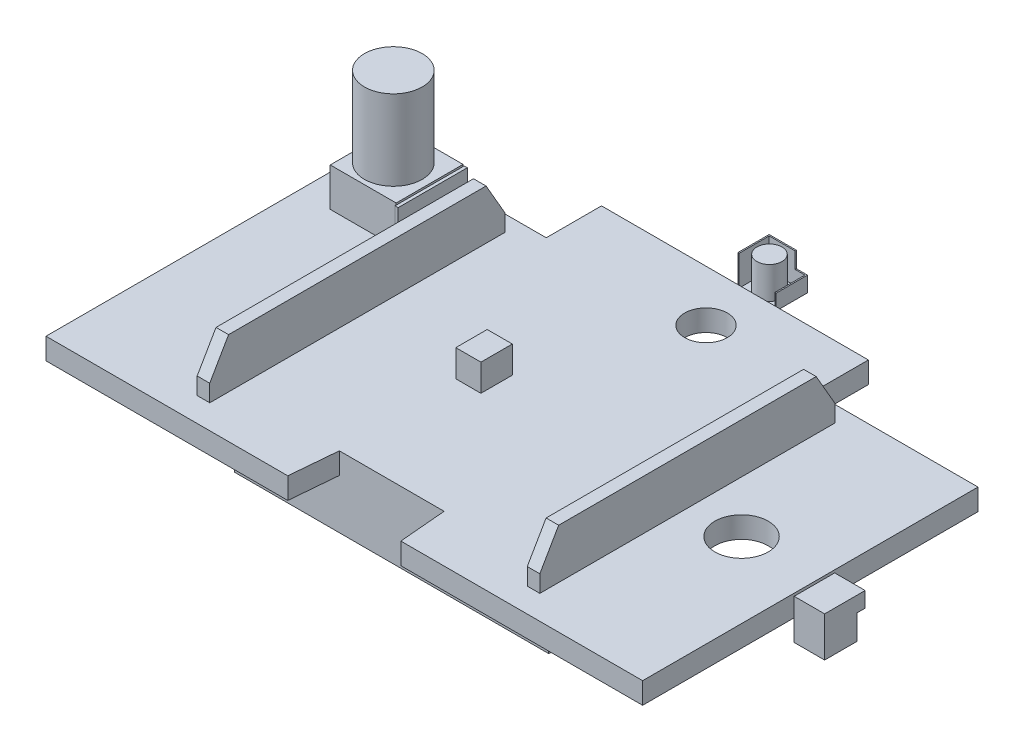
ISO-10303-21;
HEADER;
FILE_DESCRIPTION(('STEP AP214'),'2;1');
FILE_NAME('part.step','',(''),(''),'','','');
FILE_SCHEMA(('AUTOMOTIVE_DESIGN { 1 0 10303 214 1 1 1 1 }'));
ENDSEC;
DATA;
#1=APPLICATION_CONTEXT('core data for automotive mechanical design processes');
#2=APPLICATION_PROTOCOL_DEFINITION('international standard','automotive_design',2000,#1);
#3=PRODUCT_CONTEXT('',#1,'mechanical');
#4=PRODUCT('Part','Part','',(#3));
#5=PRODUCT_RELATED_PRODUCT_CATEGORY('part','',(#4));
#6=PRODUCT_DEFINITION_FORMATION('','',#4);
#7=PRODUCT_DEFINITION_CONTEXT('part definition',#1,'design');
#8=PRODUCT_DEFINITION('design','',#6,#7);
#9=PRODUCT_DEFINITION_SHAPE('','',#8);
#10=(LENGTH_UNIT() NAMED_UNIT(*) SI_UNIT(.MILLI.,.METRE.));
#11=(NAMED_UNIT(*) PLANE_ANGLE_UNIT() SI_UNIT($,.RADIAN.));
#12=(NAMED_UNIT(*) SI_UNIT($,.STERADIAN.) SOLID_ANGLE_UNIT());
#13=UNCERTAINTY_MEASURE_WITH_UNIT(LENGTH_MEASURE(1.E-05),#10,'distance_accuracy_value','');
#14=(GEOMETRIC_REPRESENTATION_CONTEXT(3) GLOBAL_UNCERTAINTY_ASSIGNED_CONTEXT((#13)) GLOBAL_UNIT_ASSIGNED_CONTEXT((#10,
#11,#12)) REPRESENTATION_CONTEXT('',''));
#15=CARTESIAN_POINT('',(0.,0.,0.));
#16=DIRECTION('',(0.,0.,1.));
#17=DIRECTION('',(1.,0.,0.));
#18=AXIS2_PLACEMENT_3D('',#15,#16,#17);
#19=CARTESIAN_POINT('',(-475.,-34.,-267.));
#20=DIRECTION('',(0.,-1.,0.));
#21=DIRECTION('',(0.,0.,-1.));
#22=AXIS2_PLACEMENT_3D('',#19,#20,#21);
#23=PLANE('',#22);
#24=CARTESIAN_POINT('',(35.42,-34.,-273.5));
#25=DIRECTION('',(0.,-1.,0.));
#26=DIRECTION('',(0.,0.,-1.));
#27=AXIS2_PLACEMENT_3D('',#24,#25,#26);
#28=CIRCLE('',#27,34.);
#29=CARTESIAN_POINT('',(35.42,-34.,-307.5));
#30=VERTEX_POINT('',#29);
#31=EDGE_CURVE('E785',#30,#30,#28,.T.);
#32=ORIENTED_EDGE('',*,*,#31,.F.);
#33=EDGE_LOOP('',(#32));
#34=FACE_BOUND('',#33,.T.);
#35=CARTESIAN_POINT('',(355.,-34.,-10.5000000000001));
#36=DIRECTION('',(0.,-1.,0.));
#37=DIRECTION('',(0.,0.,-1.));
#38=AXIS2_PLACEMENT_3D('',#35,#36,#37);
#39=CIRCLE('',#38,42.5);
#40=CARTESIAN_POINT('',(355.,-34.,-53.0000000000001));
#41=VERTEX_POINT('',#40);
#42=EDGE_CURVE('E969',#41,#41,#39,.T.);
#43=ORIENTED_EDGE('',*,*,#42,.F.);
#44=EDGE_LOOP('',(#43));
#45=FACE_BOUND('',#44,.T.);
#46=DIRECTION('',(1.,0.,0.));
#47=VECTOR('',#46,1.);
#48=CARTESIAN_POINT('',(-20.,-34.,52.));
#49=LINE('',#48,#47);
#50=CARTESIAN_POINT('',(-20.,-34.,52.));
#51=VERTEX_POINT('',#50);
#52=CARTESIAN_POINT('',(20.,-34.,52.));
#53=VERTEX_POINT('',#52);
#54=EDGE_CURVE('E1013',#51,#53,#49,.T.);
#55=ORIENTED_EDGE('',*,*,#54,.F.);
#56=DIRECTION('',(0.,0.,-1.));
#57=VECTOR('',#56,1.);
#58=CARTESIAN_POINT('',(-20.,-34.,97.));
#59=LINE('',#58,#57);
#60=CARTESIAN_POINT('',(-20.,-34.,97.));
#61=VERTEX_POINT('',#60);
#62=EDGE_CURVE('E1017',#61,#51,#59,.T.);
#63=ORIENTED_EDGE('',*,*,#62,.F.);
#64=DIRECTION('',(-1.,0.,0.));
#65=VECTOR('',#64,1.);
#66=CARTESIAN_POINT('',(-20.,-34.,97.));
#67=LINE('',#66,#65);
#68=CARTESIAN_POINT('',(20.,-34.,97.));
#69=VERTEX_POINT('',#68);
#70=EDGE_CURVE('E1005',#69,#61,#67,.T.);
#71=ORIENTED_EDGE('',*,*,#70,.F.);
#72=DIRECTION('',(0.,0.,1.));
#73=VECTOR('',#72,1.);
#74=CARTESIAN_POINT('',(20.,-34.,97.));
#75=LINE('',#74,#73);
#76=EDGE_CURVE('E1010',#53,#69,#75,.T.);
#77=ORIENTED_EDGE('',*,*,#76,.F.);
#78=EDGE_LOOP('',(#55,#63,#71,#77));
#79=FACE_BOUND('',#78,.T.);
#80=DIRECTION('',(1.,0.,0.));
#81=VECTOR('',#80,1.);
#82=CARTESIAN_POINT('',(-20.,-34.,-118.));
#83=LINE('',#82,#81);
#84=CARTESIAN_POINT('',(-20.,-34.,-118.));
#85=VERTEX_POINT('',#84);
#86=CARTESIAN_POINT('',(20.,-34.,-118.));
#87=VERTEX_POINT('',#86);
#88=EDGE_CURVE('E981',#85,#87,#83,.T.);
#89=ORIENTED_EDGE('',*,*,#88,.F.);
#90=DIRECTION('',(0.,0.,-1.));
#91=VECTOR('',#90,1.);
#92=CARTESIAN_POINT('',(-20.,-34.,-73.));
#93=LINE('',#92,#91);
#94=CARTESIAN_POINT('',(-20.,-34.,-73.));
#95=VERTEX_POINT('',#94);
#96=EDGE_CURVE('E985',#95,#85,#93,.T.);
#97=ORIENTED_EDGE('',*,*,#96,.F.);
#98=DIRECTION('',(-1.,0.,0.));
#99=VECTOR('',#98,1.);
#100=CARTESIAN_POINT('',(-20.,-34.,-73.));
#101=LINE('',#100,#99);
#102=CARTESIAN_POINT('',(20.,-34.,-73.));
#103=VERTEX_POINT('',#102);
#104=EDGE_CURVE('E973',#103,#95,#101,.T.);
#105=ORIENTED_EDGE('',*,*,#104,.F.);
#106=DIRECTION('',(0.,0.,1.));
#107=VECTOR('',#106,1.);
#108=CARTESIAN_POINT('',(20.,-34.,-73.));
#109=LINE('',#108,#107);
#110=EDGE_CURVE('E978',#87,#103,#109,.T.);
#111=ORIENTED_EDGE('',*,*,#110,.F.);
#112=EDGE_LOOP('',(#89,#97,#105,#111));
#113=FACE_BOUND('',#112,.T.);
#114=DIRECTION('',(0.,0.,-1.));
#115=VECTOR('',#114,1.);
#116=CARTESIAN_POINT('',(-250.,-34.,191.5));
#117=LINE('',#116,#115);
#118=CARTESIAN_POINT('',(-250.,-34.,191.5));
#119=VERTEX_POINT('',#118);
#120=CARTESIAN_POINT('',(-250.,-34.,171.5));
#121=VERTEX_POINT('',#120);
#122=EDGE_CURVE('E552',#119,#121,#117,.T.);
#123=ORIENTED_EDGE('',*,*,#122,.F.);
#124=DIRECTION('',(-1.,0.,0.));
#125=VECTOR('',#124,1.);
#126=CARTESIAN_POINT('',(-250.,-34.,191.5));
#127=LINE('',#126,#125);
#128=CARTESIAN_POINT('',(-83.394605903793,-34.,191.5));
#129=VERTEX_POINT('',#128);
#130=EDGE_CURVE('E597',#129,#119,#127,.T.);
#131=ORIENTED_EDGE('',*,*,#130,.F.);
#132=DIRECTION('',(-0.0871557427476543,0.,0.996194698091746));
#133=VECTOR('',#132,1.);
#134=CARTESIAN_POINT('',(-83.394605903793,-34.,191.5));
#135=LINE('',#134,#133);
#136=CARTESIAN_POINT('',(-90.,-34.,267.));
#137=VERTEX_POINT('',#136);
#138=EDGE_CURVE('E667',#129,#137,#135,.T.);
#139=ORIENTED_EDGE('',*,*,#138,.T.);
#140=DIRECTION('',(1.,0.,0.));
#141=VECTOR('',#140,1.);
#142=CARTESIAN_POINT('',(475.,-34.,267.));
#143=LINE('',#142,#141);
#144=CARTESIAN_POINT('',(-475.,-34.,267.));
#145=VERTEX_POINT('',#144);
#146=EDGE_CURVE('E1045',#145,#137,#143,.T.);
#147=ORIENTED_EDGE('',*,*,#146,.F.);
#148=DIRECTION('',(0.,0.,1.));
#149=VECTOR('',#148,1.);
#150=CARTESIAN_POINT('',(-475.,-34.,267.));
#151=LINE('',#150,#149);
#152=CARTESIAN_POINT('',(-475.,-34.,-267.));
#153=VERTEX_POINT('',#152);
#154=EDGE_CURVE('E1040',#153,#145,#151,.T.);
#155=ORIENTED_EDGE('',*,*,#154,.F.);
#156=DIRECTION('',(-1.,0.,0.));
#157=VECTOR('',#156,1.);
#158=CARTESIAN_POINT('',(-212.5,-34.,-267.));
#159=LINE('',#158,#157);
#160=CARTESIAN_POINT('',(-212.5,-34.,-267.));
#161=VERTEX_POINT('',#160);
#162=EDGE_CURVE('E1037',#161,#153,#159,.T.);
#163=ORIENTED_EDGE('',*,*,#162,.F.);
#164=DIRECTION('',(0.,0.,1.));
#165=VECTOR('',#164,1.);
#166=CARTESIAN_POINT('',(-212.5,-34.,-267.));
#167=LINE('',#166,#165);
#168=CARTESIAN_POINT('',(-212.5,-34.,-355.));
#169=VERTEX_POINT('',#168);
#170=EDGE_CURVE('E1061',#169,#161,#167,.T.);
#171=ORIENTED_EDGE('',*,*,#170,.F.);
#172=DIRECTION('',(-1.,0.,0.));
#173=VECTOR('',#172,1.);
#174=CARTESIAN_POINT('',(-212.5,-34.,-355.));
#175=LINE('',#174,#173);
#176=CARTESIAN_POINT('',(212.5,-34.,-355.));
#177=VERTEX_POINT('',#176);
#178=EDGE_CURVE('E1058',#177,#169,#175,.T.);
#179=ORIENTED_EDGE('',*,*,#178,.F.);
#180=DIRECTION('',(0.,0.,-1.));
#181=VECTOR('',#180,1.);
#182=CARTESIAN_POINT('',(212.5,-34.,-355.));
#183=LINE('',#182,#181);
#184=CARTESIAN_POINT('',(212.5,-34.,-267.));
#185=VERTEX_POINT('',#184);
#186=EDGE_CURVE('E1055',#185,#177,#183,.T.);
#187=ORIENTED_EDGE('',*,*,#186,.F.);
#188=DIRECTION('',(-1.,0.,0.));
#189=VECTOR('',#188,1.);
#190=CARTESIAN_POINT('',(475.,-34.,-267.));
#191=LINE('',#190,#189);
#192=CARTESIAN_POINT('',(475.,-34.,-267.));
#193=VERTEX_POINT('',#192);
#194=EDGE_CURVE('E1052',#193,#185,#191,.T.);
#195=ORIENTED_EDGE('',*,*,#194,.F.);
#196=DIRECTION('',(0.,0.,-1.));
#197=VECTOR('',#196,1.);
#198=CARTESIAN_POINT('',(475.,-34.,267.));
#199=LINE('',#198,#197);
#200=CARTESIAN_POINT('',(475.,-34.,-36.9848533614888));
#201=VERTEX_POINT('',#200);
#202=EDGE_CURVE('E1048',#201,#193,#199,.T.);
#203=ORIENTED_EDGE('',*,*,#202,.F.);
#204=CARTESIAN_POINT('',(489.197008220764,-34.,-10.5000000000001));
#205=DIRECTION('',(0.,-1.,0.));
#206=DIRECTION('',(0.,0.,-1.));
#207=AXIS2_PLACEMENT_3D('',#204,#205,#206);
#208=CIRCLE('',#207,30.05);
#209=CARTESIAN_POINT('',(475.,-34.,15.9848533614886));
#210=VERTEX_POINT('',#209);
#211=EDGE_CURVE('E932',#210,#201,#208,.T.);
#212=ORIENTED_EDGE('',*,*,#211,.F.);
#213=DIRECTION('',(0.,0.,-1.));
#214=VECTOR('',#213,1.);
#215=CARTESIAN_POINT('',(475.,-34.,25.6999999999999));
#216=LINE('',#215,#214);
#217=CARTESIAN_POINT('',(475.,-34.,25.6999999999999));
#218=VERTEX_POINT('',#217);
#219=EDGE_CURVE('E935',#218,#210,#216,.T.);
#220=ORIENTED_EDGE('',*,*,#219,.F.);
#221=CARTESIAN_POINT('',(475.,-34.,267.));
#222=VERTEX_POINT('',#221);
#223=EDGE_CURVE('E1049',#222,#218,#199,.T.);
#224=ORIENTED_EDGE('',*,*,#223,.F.);
#225=CARTESIAN_POINT('',(90.0000000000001,-34.,267.));
#226=VERTEX_POINT('',#225);
#227=EDGE_CURVE('E1044',#226,#222,#143,.T.);
#228=ORIENTED_EDGE('',*,*,#227,.F.);
#229=DIRECTION('',(-0.0871557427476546,0.,-0.996194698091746));
#230=VECTOR('',#229,1.);
#231=CARTESIAN_POINT('',(90.,-34.,267.));
#232=LINE('',#231,#230);
#233=CARTESIAN_POINT('',(83.394605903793,-34.,191.5));
#234=VERTEX_POINT('',#233);
#235=EDGE_CURVE('E675',#226,#234,#232,.T.);
#236=ORIENTED_EDGE('',*,*,#235,.T.);
#237=CARTESIAN_POINT('',(250.,-34.,191.5));
#238=VERTEX_POINT('',#237);
#239=EDGE_CURVE('E582',#238,#234,#127,.T.);
#240=ORIENTED_EDGE('',*,*,#239,.F.);
#241=DIRECTION('',(0.,0.,1.));
#242=VECTOR('',#241,1.);
#243=CARTESIAN_POINT('',(250.,-34.,191.5));
#244=LINE('',#243,#242);
#245=CARTESIAN_POINT('',(250.,-34.,171.5));
#246=VERTEX_POINT('',#245);
#247=EDGE_CURVE('E594',#246,#238,#244,.T.);
#248=ORIENTED_EDGE('',*,*,#247,.F.);
#249=DIRECTION('',(1.,0.,0.));
#250=VECTOR('',#249,1.);
#251=CARTESIAN_POINT('',(-250.,-34.,171.5));
#252=LINE('',#251,#250);
#253=EDGE_CURVE('E591',#121,#246,#252,.T.);
#254=ORIENTED_EDGE('',*,*,#253,.F.);
#255=EDGE_LOOP('',(#123,#131,#139,#147,#155,#163,#171,#179,#187,#195,#203,#212,#220,#224,#228,
#236,#240,#248,#254));
#256=FACE_BOUND('',#255,.T.);
#257=DIRECTION('',(1.,0.,0.));
#258=VECTOR('',#257,1.);
#259=CARTESIAN_POINT('',(-290.,-34.,-204.5));
#260=LINE('',#259,#258);
#261=CARTESIAN_POINT('',(-290.,-34.,-204.5));
#262=VERTEX_POINT('',#261);
#263=CARTESIAN_POINT('',(290.,-34.,-204.5));
#264=VERTEX_POINT('',#263);
#265=EDGE_CURVE('E546',#262,#264,#260,.T.);
#266=ORIENTED_EDGE('',*,*,#265,.F.);
#267=DIRECTION('',(0.,0.,-1.));
#268=VECTOR('',#267,1.);
#269=CARTESIAN_POINT('',(-290.,-34.,-184.5));
#270=LINE('',#269,#268);
#271=CARTESIAN_POINT('',(-290.,-34.,-184.5));
#272=VERTEX_POINT('',#271);
#273=EDGE_CURVE('E556',#272,#262,#270,.T.);
#274=ORIENTED_EDGE('',*,*,#273,.F.);
#275=DIRECTION('',(-1.,0.,0.));
#276=VECTOR('',#275,1.);
#277=CARTESIAN_POINT('',(-290.,-34.,-184.5));
#278=LINE('',#277,#276);
#279=CARTESIAN_POINT('',(290.,-34.,-184.5));
#280=VERTEX_POINT('',#279);
#281=EDGE_CURVE('E567',#280,#272,#278,.T.);
#282=ORIENTED_EDGE('',*,*,#281,.F.);
#283=DIRECTION('',(0.,0.,1.));
#284=VECTOR('',#283,1.);
#285=CARTESIAN_POINT('',(290.,-34.,-184.5));
#286=LINE('',#285,#284);
#287=EDGE_CURVE('E565',#264,#280,#286,.T.);
#288=ORIENTED_EDGE('',*,*,#287,.F.);
#289=EDGE_LOOP('',(#266,#274,#282,#288));
#290=FACE_BOUND('',#289,.T.);
#291=ADVANCED_FACE('F41',(#34,#45,#79,#113,#256,#290),#23,.T.);
#292=CARTESIAN_POINT('',(-475.,0.,-267.));
#293=DIRECTION('',(0.,-1.,0.));
#294=DIRECTION('',(0.,0.,-1.));
#295=AXIS2_PLACEMENT_3D('',#292,#293,#294);
#296=PLANE('',#295);
#297=DIRECTION('',(0.,0.,1.));
#298=VECTOR('',#297,1.);
#299=CARTESIAN_POINT('',(-272.8,0.,-241.5));
#300=LINE('',#299,#298);
#301=CARTESIAN_POINT('',(-272.8,0.,-241.5));
#302=VERTEX_POINT('',#301);
#303=CARTESIAN_POINT('',(-272.8,0.,228.5));
#304=VERTEX_POINT('',#303);
#305=EDGE_CURVE('E637',#302,#304,#300,.T.);
#306=ORIENTED_EDGE('',*,*,#305,.F.);
#307=DIRECTION('',(-1.,0.,0.));
#308=VECTOR('',#307,1.);
#309=CARTESIAN_POINT('',(-272.8,0.,-241.5));
#310=LINE('',#309,#308);
#311=CARTESIAN_POINT('',(-252.8,0.,-241.5));
#312=VERTEX_POINT('',#311);
#313=EDGE_CURVE('E642',#312,#302,#310,.T.);
#314=ORIENTED_EDGE('',*,*,#313,.F.);
#315=DIRECTION('',(0.,0.,-1.));
#316=VECTOR('',#315,1.);
#317=CARTESIAN_POINT('',(-252.8,0.,-241.5));
#318=LINE('',#317,#316);
#319=CARTESIAN_POINT('',(-252.8,0.,228.5));
#320=VERTEX_POINT('',#319);
#321=EDGE_CURVE('E651',#320,#312,#318,.T.);
#322=ORIENTED_EDGE('',*,*,#321,.F.);
#323=DIRECTION('',(1.,0.,0.));
#324=VECTOR('',#323,1.);
#325=CARTESIAN_POINT('',(-272.8,0.,228.5));
#326=LINE('',#325,#324);
#327=EDGE_CURVE('E648',#304,#320,#326,.T.);
#328=ORIENTED_EDGE('',*,*,#327,.F.);
#329=EDGE_LOOP('',(#306,#314,#322,#328));
#330=FACE_BOUND('',#329,.T.);
#331=DIRECTION('',(1.,0.,0.));
#332=VECTOR('',#331,1.);
#333=CARTESIAN_POINT('',(475.,0.,267.));
#334=LINE('',#333,#332);
#335=CARTESIAN_POINT('',(-475.,0.,267.));
#336=VERTEX_POINT('',#335);
#337=CARTESIAN_POINT('',(-90.,0.,267.));
#338=VERTEX_POINT('',#337);
#339=EDGE_CURVE('E1071',#336,#338,#334,.T.);
#340=ORIENTED_EDGE('',*,*,#339,.T.);
#341=DIRECTION('',(-0.0871557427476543,0.,0.996194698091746));
#342=VECTOR('',#341,1.);
#343=CARTESIAN_POINT('',(-83.394605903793,0.,191.5));
#344=LINE('',#343,#342);
#345=CARTESIAN_POINT('',(-83.394605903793,0.,191.5));
#346=VERTEX_POINT('',#345);
#347=EDGE_CURVE('E668',#346,#338,#344,.T.);
#348=ORIENTED_EDGE('',*,*,#347,.F.);
#349=DIRECTION('',(-1.,0.,0.));
#350=VECTOR('',#349,1.);
#351=CARTESIAN_POINT('',(83.394605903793,0.,191.5));
#352=LINE('',#351,#350);
#353=CARTESIAN_POINT('',(83.394605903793,0.,191.5));
#354=VERTEX_POINT('',#353);
#355=EDGE_CURVE('E663',#354,#346,#352,.T.);
#356=ORIENTED_EDGE('',*,*,#355,.F.);
#357=DIRECTION('',(-0.0871557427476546,0.,-0.996194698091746));
#358=VECTOR('',#357,1.);
#359=CARTESIAN_POINT('',(90.,0.,267.));
#360=LINE('',#359,#358);
#361=CARTESIAN_POINT('',(90.,0.,267.));
#362=VERTEX_POINT('',#361);
#363=EDGE_CURVE('E664',#362,#354,#360,.T.);
#364=ORIENTED_EDGE('',*,*,#363,.F.);
#365=CARTESIAN_POINT('',(475.,0.,267.));
#366=VERTEX_POINT('',#365);
#367=EDGE_CURVE('E1070',#362,#366,#334,.T.);
#368=ORIENTED_EDGE('',*,*,#367,.T.);
#369=DIRECTION('',(0.,0.,-1.));
#370=VECTOR('',#369,1.);
#371=CARTESIAN_POINT('',(475.,0.,267.));
#372=LINE('',#371,#370);
#373=CARTESIAN_POINT('',(475.,0.,-267.));
#374=VERTEX_POINT('',#373);
#375=EDGE_CURVE('E1074',#366,#374,#372,.T.);
#376=ORIENTED_EDGE('',*,*,#375,.T.);
#377=DIRECTION('',(-1.,0.,0.));
#378=VECTOR('',#377,1.);
#379=CARTESIAN_POINT('',(475.,0.,-267.));
#380=LINE('',#379,#378);
#381=CARTESIAN_POINT('',(212.5,0.,-267.));
#382=VERTEX_POINT('',#381);
#383=EDGE_CURVE('E1077',#374,#382,#380,.T.);
#384=ORIENTED_EDGE('',*,*,#383,.T.);
#385=DIRECTION('',(0.,0.,-1.));
#386=VECTOR('',#385,1.);
#387=CARTESIAN_POINT('',(212.5,0.,-355.));
#388=LINE('',#387,#386);
#389=CARTESIAN_POINT('',(212.5,0.,-355.));
#390=VERTEX_POINT('',#389);
#391=EDGE_CURVE('E1080',#382,#390,#388,.T.);
#392=ORIENTED_EDGE('',*,*,#391,.T.);
#393=DIRECTION('',(-1.,0.,0.));
#394=VECTOR('',#393,1.);
#395=CARTESIAN_POINT('',(-212.5,0.,-355.));
#396=LINE('',#395,#394);
#397=CARTESIAN_POINT('',(65.46,0.,-355.));
#398=VERTEX_POINT('',#397);
#399=EDGE_CURVE('E1084',#390,#398,#396,.T.);
#400=ORIENTED_EDGE('',*,*,#399,.T.);
#401=CARTESIAN_POINT('',(63.46,0.,-355.));
#402=VERTEX_POINT('',#401);
#403=EDGE_CURVE('E1087',#398,#402,#396,.T.);
#404=ORIENTED_EDGE('',*,*,#403,.T.);
#405=DIRECTION('',(-1.,0.,0.));
#406=VECTOR('',#405,1.);
#407=CARTESIAN_POINT('',(-475.,0.,-355.));
#408=LINE('',#407,#406);
#409=CARTESIAN_POINT('',(36.4440737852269,0.,-355.));
#410=VERTEX_POINT('',#409);
#411=EDGE_CURVE('E734',#402,#410,#408,.T.);
#412=ORIENTED_EDGE('',*,*,#411,.T.);
#413=CARTESIAN_POINT('',(34.96,0.,-374.995));
#414=DIRECTION('',(0.,-1.,0.));
#415=DIRECTION('',(0.,0.,-1.));
#416=AXIS2_PLACEMENT_3D('',#413,#414,#415);
#417=CIRCLE('',#416,20.05);
#418=CARTESIAN_POINT('',(33.4759262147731,0.,-355.));
#419=VERTEX_POINT('',#418);
#420=EDGE_CURVE('E695',#419,#410,#417,.F.);
#421=ORIENTED_EDGE('',*,*,#420,.F.);
#422=CARTESIAN_POINT('',(6.45999999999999,0.,-355.));
#423=VERTEX_POINT('',#422);
#424=EDGE_CURVE('E733',#419,#423,#408,.T.);
#425=ORIENTED_EDGE('',*,*,#424,.T.);
#426=CARTESIAN_POINT('',(4.45999999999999,0.,-355.));
#427=VERTEX_POINT('',#426);
#428=EDGE_CURVE('E1088',#423,#427,#396,.T.);
#429=ORIENTED_EDGE('',*,*,#428,.T.);
#430=CARTESIAN_POINT('',(-212.5,0.,-355.));
#431=VERTEX_POINT('',#430);
#432=EDGE_CURVE('E1083',#427,#431,#396,.T.);
#433=ORIENTED_EDGE('',*,*,#432,.T.);
#434=DIRECTION('',(0.,0.,1.));
#435=VECTOR('',#434,1.);
#436=CARTESIAN_POINT('',(-212.5,0.,-267.));
#437=LINE('',#436,#435);
#438=CARTESIAN_POINT('',(-212.5,0.,-267.));
#439=VERTEX_POINT('',#438);
#440=EDGE_CURVE('E1041',#431,#439,#437,.T.);
#441=ORIENTED_EDGE('',*,*,#440,.T.);
#442=DIRECTION('',(-1.,0.,0.));
#443=VECTOR('',#442,1.);
#444=CARTESIAN_POINT('',(-212.5,0.,-267.));
#445=LINE('',#444,#443);
#446=CARTESIAN_POINT('',(-475.,0.,-267.));
#447=VERTEX_POINT('',#446);
#448=EDGE_CURVE('E1023',#439,#447,#445,.T.);
#449=ORIENTED_EDGE('',*,*,#448,.T.);
#450=DIRECTION('',(0.,0.,1.));
#451=VECTOR('',#450,1.);
#452=CARTESIAN_POINT('',(-475.,0.,267.));
#453=LINE('',#452,#451);
#454=EDGE_CURVE('E1067',#447,#336,#453,.T.);
#455=ORIENTED_EDGE('',*,*,#454,.T.);
#456=EDGE_LOOP('',(#340,#348,#356,#364,#368,#376,#384,#392,#400,#404,#412,#421,#425,#429,#433,
#441,#449,#455));
#457=FACE_BOUND('',#456,.T.);
#458=CARTESIAN_POINT('',(35.42,0.,-273.5));
#459=DIRECTION('',(0.,1.,0.));
#460=DIRECTION('',(0.,0.,1.));
#461=AXIS2_PLACEMENT_3D('',#458,#459,#460);
#462=CIRCLE('',#461,34.);
#463=CARTESIAN_POINT('',(35.42,0.,-239.5));
#464=VERTEX_POINT('',#463);
#465=EDGE_CURVE('E782',#464,#464,#462,.T.);
#466=ORIENTED_EDGE('',*,*,#465,.F.);
#467=EDGE_LOOP('',(#466));
#468=FACE_BOUND('',#467,.T.);
#469=DIRECTION('',(1.,0.,0.));
#470=VECTOR('',#469,1.);
#471=CARTESIAN_POINT('',(-311.9,0.,-125.73));
#472=LINE('',#471,#470);
#473=CARTESIAN_POINT('',(-311.9,0.,-125.73));
#474=VERTEX_POINT('',#473);
#475=CARTESIAN_POINT('',(-277.5,0.,-125.73));
#476=VERTEX_POINT('',#475);
#477=EDGE_CURVE('E883',#474,#476,#472,.T.);
#478=ORIENTED_EDGE('',*,*,#477,.F.);
#479=DIRECTION('',(0.,0.,-1.));
#480=VECTOR('',#479,1.);
#481=CARTESIAN_POINT('',(-311.9,0.,-125.73));
#482=LINE('',#481,#480);
#483=CARTESIAN_POINT('',(-311.9,0.,-235.73));
#484=VERTEX_POINT('',#483);
#485=EDGE_CURVE('E900',#474,#484,#482,.T.);
#486=ORIENTED_EDGE('',*,*,#485,.T.);
#487=DIRECTION('',(1.,0.,0.));
#488=VECTOR('',#487,1.);
#489=CARTESIAN_POINT('',(-311.9,0.,-235.73));
#490=LINE('',#489,#488);
#491=CARTESIAN_POINT('',(-277.5,0.,-235.73));
#492=VERTEX_POINT('',#491);
#493=EDGE_CURVE('E882',#484,#492,#490,.T.);
#494=ORIENTED_EDGE('',*,*,#493,.T.);
#495=DIRECTION('',(0.,0.,-1.));
#496=VECTOR('',#495,1.);
#497=CARTESIAN_POINT('',(-277.5,0.,-125.73));
#498=LINE('',#497,#496);
#499=EDGE_CURVE('E928',#476,#492,#498,.T.);
#500=ORIENTED_EDGE('',*,*,#499,.F.);
#501=EDGE_LOOP('',(#478,#486,#494,#500));
#502=FACE_BOUND('',#501,.T.);
#503=CARTESIAN_POINT('',(355.,0.,-10.5000000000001));
#504=DIRECTION('',(0.,1.,0.));
#505=DIRECTION('',(0.,0.,1.));
#506=AXIS2_PLACEMENT_3D('',#503,#504,#505);
#507=CIRCLE('',#506,42.5);
#508=CARTESIAN_POINT('',(355.,0.,31.9999999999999));
#509=VERTEX_POINT('',#508);
#510=EDGE_CURVE('E965',#509,#509,#507,.T.);
#511=ORIENTED_EDGE('',*,*,#510,.F.);
#512=EDGE_LOOP('',(#511));
#513=FACE_BOUND('',#512,.T.);
#514=DIRECTION('',(0.,0.,1.));
#515=VECTOR('',#514,1.);
#516=CARTESIAN_POINT('',(-90.,0.,-0.499999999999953));
#517=LINE('',#516,#515);
#518=CARTESIAN_POINT('',(-90.,0.,-50.5));
#519=VERTEX_POINT('',#518);
#520=CARTESIAN_POINT('',(-90.0000000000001,0.,-0.499999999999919));
#521=VERTEX_POINT('',#520);
#522=EDGE_CURVE('E797',#519,#521,#517,.T.);
#523=ORIENTED_EDGE('',*,*,#522,.F.);
#524=DIRECTION('',(-1.,0.,0.));
#525=VECTOR('',#524,1.);
#526=CARTESIAN_POINT('',(-90.,0.,-50.5));
#527=LINE('',#526,#525);
#528=CARTESIAN_POINT('',(-50.,0.,-50.4999999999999));
#529=VERTEX_POINT('',#528);
#530=EDGE_CURVE('E790',#529,#519,#527,.T.);
#531=ORIENTED_EDGE('',*,*,#530,.F.);
#532=DIRECTION('',(0.,0.,-1.));
#533=VECTOR('',#532,1.);
#534=CARTESIAN_POINT('',(-50.,0.,-0.49999999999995));
#535=LINE('',#534,#533);
#536=CARTESIAN_POINT('',(-50.0000000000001,0.,-0.499999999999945));
#537=VERTEX_POINT('',#536);
#538=EDGE_CURVE('E803',#537,#529,#535,.T.);
#539=ORIENTED_EDGE('',*,*,#538,.F.);
#540=DIRECTION('',(1.,0.,0.));
#541=VECTOR('',#540,1.);
#542=CARTESIAN_POINT('',(-90.,0.,-0.499999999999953));
#543=LINE('',#542,#541);
#544=EDGE_CURVE('E800',#521,#537,#543,.T.);
#545=ORIENTED_EDGE('',*,*,#544,.F.);
#546=EDGE_LOOP('',(#523,#531,#539,#545));
#547=FACE_BOUND('',#546,.T.);
#548=DIRECTION('',(0.,0.,1.));
#549=VECTOR('',#548,1.);
#550=CARTESIAN_POINT('',(252.8,0.,-241.5));
#551=LINE('',#550,#549);
#552=CARTESIAN_POINT('',(252.8,0.,-241.5));
#553=VERTEX_POINT('',#552);
#554=CARTESIAN_POINT('',(252.8,0.,228.5));
#555=VERTEX_POINT('',#554);
#556=EDGE_CURVE('E611',#553,#555,#551,.T.);
#557=ORIENTED_EDGE('',*,*,#556,.F.);
#558=DIRECTION('',(-1.,0.,0.));
#559=VECTOR('',#558,1.);
#560=CARTESIAN_POINT('',(252.8,0.,-241.5));
#561=LINE('',#560,#559);
#562=CARTESIAN_POINT('',(272.8,0.,-241.5));
#563=VERTEX_POINT('',#562);
#564=EDGE_CURVE('E616',#563,#553,#561,.T.);
#565=ORIENTED_EDGE('',*,*,#564,.F.);
#566=DIRECTION('',(0.,0.,-1.));
#567=VECTOR('',#566,1.);
#568=CARTESIAN_POINT('',(272.8,0.,-241.5));
#569=LINE('',#568,#567);
#570=CARTESIAN_POINT('',(272.8,0.,228.5));
#571=VERTEX_POINT('',#570);
#572=EDGE_CURVE('E625',#571,#563,#569,.T.);
#573=ORIENTED_EDGE('',*,*,#572,.F.);
#574=DIRECTION('',(1.,0.,0.));
#575=VECTOR('',#574,1.);
#576=CARTESIAN_POINT('',(252.8,0.,228.5));
#577=LINE('',#576,#575);
#578=EDGE_CURVE('E622',#555,#571,#577,.T.);
#579=ORIENTED_EDGE('',*,*,#578,.F.);
#580=EDGE_LOOP('',(#557,#565,#573,#579));
#581=FACE_BOUND('',#580,.T.);
#582=ADVANCED_FACE('F1200',(#330,#457,#468,#502,#513,#547,#581),#296,.F.);
#583=CARTESIAN_POINT('',(475.,-34.,267.));
#584=DIRECTION('',(0.,0.,1.));
#585=DIRECTION('',(1.,0.,0.));
#586=AXIS2_PLACEMENT_3D('',#583,#584,#585);
#587=PLANE('',#586);
#588=DIRECTION('',(0.,1.,0.));
#589=VECTOR('',#588,1.);
#590=CARTESIAN_POINT('',(-90.,-229.19285335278,267.));
#591=LINE('',#590,#589);
#592=EDGE_CURVE('E674',#137,#338,#591,.T.);
#593=ORIENTED_EDGE('',*,*,#592,.T.);
#594=ORIENTED_EDGE('',*,*,#339,.F.);
#595=DIRECTION('',(0.,1.,0.));
#596=VECTOR('',#595,1.);
#597=CARTESIAN_POINT('',(-475.,-34.,267.));
#598=LINE('',#597,#596);
#599=EDGE_CURVE('E1106',#145,#336,#598,.T.);
#600=ORIENTED_EDGE('',*,*,#599,.F.);
#601=ORIENTED_EDGE('',*,*,#146,.T.);
#602=EDGE_LOOP('',(#593,#594,#600,#601));
#603=FACE_BOUND('',#602,.T.);
#604=ADVANCED_FACE('F1202',(#603),#587,.T.);
#605=CARTESIAN_POINT('',(6.45999999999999,-4.,-355.));
#606=DIRECTION('',(0.,0.,1.));
#607=DIRECTION('',(1.,0.,0.));
#608=AXIS2_PLACEMENT_3D('',#605,#606,#607);
#609=PLANE('',#608);
#610=DIRECTION('',(0.,-1.,0.));
#611=VECTOR('',#610,1.);
#612=CARTESIAN_POINT('',(33.4759262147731,47.,-355.));
#613=LINE('',#612,#611);
#614=CARTESIAN_POINT('',(33.4759262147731,-4.,-355.));
#615=VERTEX_POINT('',#614);
#616=EDGE_CURVE('E698',#615,#419,#613,.F.);
#617=ORIENTED_EDGE('',*,*,#616,.F.);
#618=DIRECTION('',(1.,0.,0.));
#619=VECTOR('',#618,1.);
#620=CARTESIAN_POINT('',(6.45999999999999,-4.,-355.));
#621=LINE('',#620,#619);
#622=CARTESIAN_POINT('',(6.45999999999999,-4.,-355.));
#623=VERTEX_POINT('',#622);
#624=EDGE_CURVE('E713',#623,#615,#621,.T.);
#625=ORIENTED_EDGE('',*,*,#624,.F.);
#626=DIRECTION('',(0.,1.,0.));
#627=VECTOR('',#626,1.);
#628=CARTESIAN_POINT('',(6.45999999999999,-4.,-355.));
#629=LINE('',#628,#627);
#630=EDGE_CURVE('E723',#623,#423,#629,.T.);
#631=ORIENTED_EDGE('',*,*,#630,.T.);
#632=ORIENTED_EDGE('',*,*,#424,.F.);
#633=EDGE_LOOP('',(#617,#625,#631,#632));
#634=FACE_BOUND('',#633,.T.);
#635=ADVANCED_FACE('F1209',(#634),#609,.F.);
#636=DIRECTION('',(0.,-1.,0.));
#637=VECTOR('',#636,1.);
#638=CARTESIAN_POINT('',(36.4440737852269,47.,-355.));
#639=LINE('',#638,#637);
#640=CARTESIAN_POINT('',(36.4440737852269,-4.,-355.));
#641=VERTEX_POINT('',#640);
#642=EDGE_CURVE('E690',#410,#641,#639,.T.);
#643=ORIENTED_EDGE('',*,*,#642,.F.);
#644=ORIENTED_EDGE('',*,*,#411,.F.);
#645=DIRECTION('',(0.,1.,0.));
#646=VECTOR('',#645,1.);
#647=CARTESIAN_POINT('',(63.46,-4.,-355.));
#648=LINE('',#647,#646);
#649=CARTESIAN_POINT('',(63.46,-4.,-355.));
#650=VERTEX_POINT('',#649);
#651=EDGE_CURVE('E718',#650,#402,#648,.T.);
#652=ORIENTED_EDGE('',*,*,#651,.F.);
#653=EDGE_CURVE('E712',#641,#650,#621,.T.);
#654=ORIENTED_EDGE('',*,*,#653,.F.);
#655=EDGE_LOOP('',(#643,#644,#652,#654));
#656=FACE_BOUND('',#655,.T.);
#657=ADVANCED_FACE('F1334',(#656),#609,.F.);
#658=CARTESIAN_POINT('',(0.,0.,-355.));
#659=DIRECTION('',(0.,0.,1.));
#660=DIRECTION('',(1.,0.,0.));
#661=AXIS2_PLACEMENT_3D('',#658,#659,#660);
#662=PLANE('',#661);
#663=CARTESIAN_POINT('',(63.46,18.5,-355.));
#664=VERTEX_POINT('',#663);
#665=EDGE_CURVE('E722',#402,#664,#648,.T.);
#666=ORIENTED_EDGE('',*,*,#665,.F.);
#667=ORIENTED_EDGE('',*,*,#403,.F.);
#668=DIRECTION('',(0.,-1.,0.));
#669=VECTOR('',#668,1.);
#670=CARTESIAN_POINT('',(65.46,-6.,-355.));
#671=LINE('',#670,#669);
#672=CARTESIAN_POINT('',(65.46,18.5,-355.));
#673=VERTEX_POINT('',#672);
#674=EDGE_CURVE('E751',#673,#398,#671,.T.);
#675=ORIENTED_EDGE('',*,*,#674,.F.);
#676=DIRECTION('',(1.,0.,0.));
#677=VECTOR('',#676,1.);
#678=CARTESIAN_POINT('',(65.46,18.5,-355.));
#679=LINE('',#678,#677);
#680=EDGE_CURVE('E746',#664,#673,#679,.T.);
#681=ORIENTED_EDGE('',*,*,#680,.F.);
#682=EDGE_LOOP('',(#666,#667,#675,#681));
#683=FACE_BOUND('',#682,.T.);
#684=ADVANCED_FACE('F1366',(#683),#662,.T.);
#685=CARTESIAN_POINT('',(457.5,-4.3,25.7));
#686=DIRECTION('',(0.,1.,0.));
#687=DIRECTION('',(0.,0.,1.));
#688=AXIS2_PLACEMENT_3D('',#685,#686,#687);
#689=PLANE('',#688);
#690=DIRECTION('',(0.,0.,1.));
#691=VECTOR('',#690,1.);
#692=CARTESIAN_POINT('',(523.5,-4.3,25.7));
#693=LINE('',#692,#691);
#694=CARTESIAN_POINT('',(523.5,-4.3,-38.8));
#695=VERTEX_POINT('',#694);
#696=CARTESIAN_POINT('',(523.5,-4.3,25.7));
#697=VERTEX_POINT('',#696);
#698=EDGE_CURVE('E959',#695,#697,#693,.T.);
#699=ORIENTED_EDGE('',*,*,#698,.F.);
#700=DIRECTION('',(1.,0.,0.));
#701=VECTOR('',#700,1.);
#702=CARTESIAN_POINT('',(475.,-4.3,-38.8));
#703=LINE('',#702,#701);
#704=CARTESIAN_POINT('',(475.,-4.3,-38.8));
#705=VERTEX_POINT('',#704);
#706=EDGE_CURVE('E819',#705,#695,#703,.T.);
#707=ORIENTED_EDGE('',*,*,#706,.F.);
#708=DIRECTION('',(0.,0.,1.));
#709=VECTOR('',#708,1.);
#710=CARTESIAN_POINT('',(475.,-4.3,267.));
#711=LINE('',#710,#709);
#712=CARTESIAN_POINT('',(475.,-4.3,25.7));
#713=VERTEX_POINT('',#712);
#714=EDGE_CURVE('E1093',#705,#713,#711,.T.);
#715=ORIENTED_EDGE('',*,*,#714,.T.);
#716=DIRECTION('',(1.,0.,0.));
#717=VECTOR('',#716,1.);
#718=CARTESIAN_POINT('',(457.5,-4.3,25.7));
#719=LINE('',#718,#717);
#720=EDGE_CURVE('E962',#713,#697,#719,.T.);
#721=ORIENTED_EDGE('',*,*,#720,.T.);
#722=EDGE_LOOP('',(#699,#707,#715,#721));
#723=FACE_BOUND('',#722,.T.);
#724=ADVANCED_FACE('F1492',(#723),#689,.T.);
#725=CARTESIAN_POINT('',(523.5,-68.,25.7));
#726=DIRECTION('',(1.,0.,0.));
#727=DIRECTION('',(0.,0.,-1.));
#728=AXIS2_PLACEMENT_3D('',#725,#726,#727);
#729=PLANE('',#728);
#730=DIRECTION('',(0.,0.,1.));
#731=VECTOR('',#730,1.);
#732=CARTESIAN_POINT('',(523.5,-28.7,0.));
#733=LINE('',#732,#731);
#734=CARTESIAN_POINT('',(523.5,-28.7,-38.8000000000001));
#735=VERTEX_POINT('',#734);
#736=CARTESIAN_POINT('',(523.5,-28.7,-25.8000000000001));
#737=VERTEX_POINT('',#736);
#738=EDGE_CURVE('E832',#735,#737,#733,.T.);
#739=ORIENTED_EDGE('',*,*,#738,.F.);
#740=DIRECTION('',(0.,-1.,0.));
#741=VECTOR('',#740,1.);
#742=CARTESIAN_POINT('',(523.5,-4.3,-38.8));
#743=LINE('',#742,#741);
#744=EDGE_CURVE('E821',#695,#735,#743,.T.);
#745=ORIENTED_EDGE('',*,*,#744,.F.);
#746=ORIENTED_EDGE('',*,*,#698,.T.);
#747=DIRECTION('',(0.,-1.,0.));
#748=VECTOR('',#747,1.);
#749=CARTESIAN_POINT('',(523.5,-4.3,25.7));
#750=LINE('',#749,#748);
#751=CARTESIAN_POINT('',(523.5,-68.,25.7));
#752=VERTEX_POINT('',#751);
#753=EDGE_CURVE('E938',#697,#752,#750,.T.);
#754=ORIENTED_EDGE('',*,*,#753,.T.);
#755=DIRECTION('',(0.,0.,-1.));
#756=VECTOR('',#755,1.);
#757=CARTESIAN_POINT('',(523.5,-68.,25.7));
#758=LINE('',#757,#756);
#759=CARTESIAN_POINT('',(523.5,-68.,-25.8000000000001));
#760=VERTEX_POINT('',#759);
#761=EDGE_CURVE('E956',#752,#760,#758,.T.);
#762=ORIENTED_EDGE('',*,*,#761,.T.);
#763=DIRECTION('',(0.,-1.,0.));
#764=VECTOR('',#763,1.);
#765=CARTESIAN_POINT('',(523.5,61.8449268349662,-25.8000000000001));
#766=LINE('',#765,#764);
#767=EDGE_CURVE('E946',#737,#760,#766,.T.);
#768=ORIENTED_EDGE('',*,*,#767,.F.);
#769=EDGE_LOOP('',(#739,#745,#746,#754,#762,#768));
#770=FACE_BOUND('',#769,.T.);
#771=ADVANCED_FACE('F1417',(#770),#729,.T.);
#772=CARTESIAN_POINT('',(0.,-28.7,0.));
#773=DIRECTION('',(0.,-1.,0.));
#774=DIRECTION('',(0.,0.,-1.));
#775=AXIS2_PLACEMENT_3D('',#772,#773,#774);
#776=PLANE('',#775);
#777=DIRECTION('',(0.,0.,1.));
#778=VECTOR('',#777,1.);
#779=CARTESIAN_POINT('',(475.,-28.7,0.));
#780=LINE('',#779,#778);
#781=CARTESIAN_POINT('',(475.,-28.7,-38.8000000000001));
#782=VERTEX_POINT('',#781);
#783=CARTESIAN_POINT('',(475.,-28.7,-36.9848533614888));
#784=VERTEX_POINT('',#783);
#785=EDGE_CURVE('E829',#782,#784,#780,.T.);
#786=ORIENTED_EDGE('',*,*,#785,.F.);
#787=DIRECTION('',(1.,0.,0.));
#788=VECTOR('',#787,1.);
#789=CARTESIAN_POINT('',(0.,-28.7,-38.8000000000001));
#790=LINE('',#789,#788);
#791=CARTESIAN_POINT('',(479.091935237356,-28.7,-38.8000000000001));
#792=VERTEX_POINT('',#791);
#793=EDGE_CURVE('E1119',#782,#792,#790,.T.);
#794=ORIENTED_EDGE('',*,*,#793,.T.);
#795=CARTESIAN_POINT('',(489.197008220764,-28.7,-10.5000000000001));
#796=DIRECTION('',(0.,-1.,0.));
#797=DIRECTION('',(0.,0.,-1.));
#798=AXIS2_PLACEMENT_3D('',#795,#796,#797);
#799=CIRCLE('',#798,30.05);
#800=EDGE_CURVE('E837',#792,#784,#799,.F.);
#801=ORIENTED_EDGE('',*,*,#800,.T.);
#802=EDGE_LOOP('',(#786,#794,#801));
#803=FACE_BOUND('',#802,.T.);
#804=ADVANCED_FACE('F1413',(#803),#776,.T.);
#805=CARTESIAN_POINT('',(515.060351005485,-28.7,-25.8));
#806=VERTEX_POINT('',#805);
#807=CARTESIAN_POINT('',(499.302081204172,-28.7,-38.8000000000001));
#808=VERTEX_POINT('',#807);
#809=EDGE_CURVE('E838',#806,#808,#799,.F.);
#810=ORIENTED_EDGE('',*,*,#809,.T.);
#811=DIRECTION('',(-1.,0.,0.));
#812=VECTOR('',#811,1.);
#813=CARTESIAN_POINT('',(523.5,-28.7,-38.8000000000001));
#814=LINE('',#813,#812);
#815=EDGE_CURVE('E824',#735,#808,#814,.T.);
#816=ORIENTED_EDGE('',*,*,#815,.F.);
#817=ORIENTED_EDGE('',*,*,#738,.T.);
#818=DIRECTION('',(-1.,0.,0.));
#819=VECTOR('',#818,1.);
#820=CARTESIAN_POINT('',(0.,-28.7,-25.7999999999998));
#821=LINE('',#820,#819);
#822=EDGE_CURVE('E834',#737,#806,#821,.T.);
#823=ORIENTED_EDGE('',*,*,#822,.T.);
#824=EDGE_LOOP('',(#810,#816,#817,#823));
#825=FACE_BOUND('',#824,.T.);
#826=ADVANCED_FACE('F1416',(#825),#776,.T.);
#827=CARTESIAN_POINT('',(-311.9,65.,-125.73));
#828=DIRECTION('',(1.,0.,0.));
#829=DIRECTION('',(0.,0.,-1.));
#830=AXIS2_PLACEMENT_3D('',#827,#828,#829);
#831=PLANE('',#830);
#832=DIRECTION('',(0.,1.,0.));
#833=VECTOR('',#832,1.);
#834=CARTESIAN_POINT('',(-311.9,65.,-127.48));
#835=LINE('',#834,#833);
#836=CARTESIAN_POINT('',(-311.9,6.7,-127.48));
#837=VERTEX_POINT('',#836);
#838=CARTESIAN_POINT('',(-311.9,65.,-127.48));
#839=VERTEX_POINT('',#838);
#840=EDGE_CURVE('E1116',#837,#839,#835,.T.);
#841=ORIENTED_EDGE('',*,*,#840,.F.);
#842=DIRECTION('',(0.,0.,-1.));
#843=VECTOR('',#842,1.);
#844=CARTESIAN_POINT('',(-311.9,6.7,-233.98));
#845=LINE('',#844,#843);
#846=CARTESIAN_POINT('',(-311.9,6.7,-233.98));
#847=VERTEX_POINT('',#846);
#848=EDGE_CURVE('E868',#837,#847,#845,.T.);
#849=ORIENTED_EDGE('',*,*,#848,.T.);
#850=DIRECTION('',(0.,-1.,0.));
#851=VECTOR('',#850,1.);
#852=CARTESIAN_POINT('',(-311.9,65.,-233.98));
#853=LINE('',#852,#851);
#854=CARTESIAN_POINT('',(-311.9,65.,-233.98));
#855=VERTEX_POINT('',#854);
#856=EDGE_CURVE('E1113',#855,#847,#853,.T.);
#857=ORIENTED_EDGE('',*,*,#856,.F.);
#858=DIRECTION('',(0.,0.,-1.));
#859=VECTOR('',#858,1.);
#860=CARTESIAN_POINT('',(-311.9,65.,-125.73));
#861=LINE('',#860,#859);
#862=CARTESIAN_POINT('',(-311.9,65.,-235.73));
#863=VERTEX_POINT('',#862);
#864=EDGE_CURVE('E917',#855,#863,#861,.T.);
#865=ORIENTED_EDGE('',*,*,#864,.T.);
#866=DIRECTION('',(0.,-1.,0.));
#867=VECTOR('',#866,1.);
#868=CARTESIAN_POINT('',(-311.9,65.,-235.73));
#869=LINE('',#868,#867);
#870=EDGE_CURVE('E886',#863,#484,#869,.T.);
#871=ORIENTED_EDGE('',*,*,#870,.T.);
#872=ORIENTED_EDGE('',*,*,#485,.F.);
#873=DIRECTION('',(0.,-1.,0.));
#874=VECTOR('',#873,1.);
#875=CARTESIAN_POINT('',(-311.9,65.,-125.73));
#876=LINE('',#875,#874);
#877=CARTESIAN_POINT('',(-311.9,65.,-125.73));
#878=VERTEX_POINT('',#877);
#879=EDGE_CURVE('E898',#878,#474,#876,.T.);
#880=ORIENTED_EDGE('',*,*,#879,.F.);
#881=EDGE_CURVE('E918',#878,#839,#861,.T.);
#882=ORIENTED_EDGE('',*,*,#881,.T.);
#883=EDGE_LOOP('',(#841,#849,#857,#865,#871,#872,#880,#882));
#884=FACE_BOUND('',#883,.T.);
#885=ADVANCED_FACE('F1249',(#884),#831,.F.);
#886=CARTESIAN_POINT('',(-212.5,-34.,-267.));
#887=DIRECTION('',(0.,0.,-1.));
#888=DIRECTION('',(-1.,0.,0.));
#889=AXIS2_PLACEMENT_3D('',#886,#887,#888);
#890=PLANE('',#889);
#891=ORIENTED_EDGE('',*,*,#448,.F.);
#892=DIRECTION('',(0.,1.,0.));
#893=VECTOR('',#892,1.);
#894=CARTESIAN_POINT('',(-212.5,-34.,-267.));
#895=LINE('',#894,#893);
#896=EDGE_CURVE('E1091',#161,#439,#895,.T.);
#897=ORIENTED_EDGE('',*,*,#896,.F.);
#898=ORIENTED_EDGE('',*,*,#162,.T.);
#899=DIRECTION('',(0.,1.,0.));
#900=VECTOR('',#899,1.);
#901=CARTESIAN_POINT('',(-475.,-34.,-267.));
#902=LINE('',#901,#900);
#903=EDGE_CURVE('E1064',#153,#447,#902,.T.);
#904=ORIENTED_EDGE('',*,*,#903,.T.);
#905=EDGE_LOOP('',(#891,#897,#898,#904));
#906=FACE_BOUND('',#905,.T.);
#907=ADVANCED_FACE('F1223',(#906),#890,.T.);
#908=CARTESIAN_POINT('',(-212.5,-34.,-267.));
#909=DIRECTION('',(-1.,0.,0.));
#910=DIRECTION('',(0.,0.,1.));
#911=AXIS2_PLACEMENT_3D('',#908,#909,#910);
#912=PLANE('',#911);
#913=ORIENTED_EDGE('',*,*,#440,.F.);
#914=DIRECTION('',(0.,1.,0.));
#915=VECTOR('',#914,1.);
#916=CARTESIAN_POINT('',(-212.5,-34.,-355.));
#917=LINE('',#916,#915);
#918=EDGE_CURVE('E1094',#169,#431,#917,.T.);
#919=ORIENTED_EDGE('',*,*,#918,.F.);
#920=ORIENTED_EDGE('',*,*,#170,.T.);
#921=ORIENTED_EDGE('',*,*,#896,.T.);
#922=EDGE_LOOP('',(#913,#919,#920,#921));
#923=FACE_BOUND('',#922,.T.);
#924=ADVANCED_FACE('F1219',(#923),#912,.T.);
#925=CARTESIAN_POINT('',(-212.5,-34.,-355.));
#926=DIRECTION('',(0.,0.,-1.));
#927=DIRECTION('',(-1.,0.,0.));
#928=AXIS2_PLACEMENT_3D('',#925,#926,#927);
#929=PLANE('',#928);
#930=CARTESIAN_POINT('',(65.46,-6.,-355.));
#931=VERTEX_POINT('',#930);
#932=EDGE_CURVE('E765',#398,#931,#671,.T.);
#933=ORIENTED_EDGE('',*,*,#932,.F.);
#934=ORIENTED_EDGE('',*,*,#399,.F.);
#935=DIRECTION('',(0.,1.,0.));
#936=VECTOR('',#935,1.);
#937=CARTESIAN_POINT('',(212.5,-34.,-355.));
#938=LINE('',#937,#936);
#939=EDGE_CURVE('E1097',#177,#390,#938,.T.);
#940=ORIENTED_EDGE('',*,*,#939,.F.);
#941=ORIENTED_EDGE('',*,*,#178,.T.);
#942=ORIENTED_EDGE('',*,*,#918,.T.);
#943=ORIENTED_EDGE('',*,*,#432,.F.);
#944=DIRECTION('',(0.,1.,0.));
#945=VECTOR('',#944,1.);
#946=CARTESIAN_POINT('',(4.45999999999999,-6.,-355.));
#947=LINE('',#946,#945);
#948=CARTESIAN_POINT('',(4.45999999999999,-6.,-355.));
#949=VERTEX_POINT('',#948);
#950=EDGE_CURVE('E769',#949,#427,#947,.T.);
#951=ORIENTED_EDGE('',*,*,#950,.F.);
#952=DIRECTION('',(-1.,0.,0.));
#953=VECTOR('',#952,1.);
#954=CARTESIAN_POINT('',(65.46,-6.,-355.));
#955=LINE('',#954,#953);
#956=EDGE_CURVE('E764',#931,#949,#955,.T.);
#957=ORIENTED_EDGE('',*,*,#956,.F.);
#958=EDGE_LOOP('',(#933,#934,#940,#941,#942,#943,#951,#957));
#959=FACE_BOUND('',#958,.T.);
#960=ADVANCED_FACE('F1222',(#959),#929,.T.);
#961=CARTESIAN_POINT('',(212.5,-34.,-355.));
#962=DIRECTION('',(1.,0.,0.));
#963=DIRECTION('',(0.,0.,-1.));
#964=AXIS2_PLACEMENT_3D('',#961,#962,#963);
#965=PLANE('',#964);
#966=ORIENTED_EDGE('',*,*,#391,.F.);
#967=DIRECTION('',(0.,1.,0.));
#968=VECTOR('',#967,1.);
#969=CARTESIAN_POINT('',(212.5,-34.,-267.));
#970=LINE('',#969,#968);
#971=EDGE_CURVE('E1099',#185,#382,#970,.T.);
#972=ORIENTED_EDGE('',*,*,#971,.F.);
#973=ORIENTED_EDGE('',*,*,#186,.T.);
#974=ORIENTED_EDGE('',*,*,#939,.T.);
#975=EDGE_LOOP('',(#966,#972,#973,#974));
#976=FACE_BOUND('',#975,.T.);
#977=ADVANCED_FACE('F1227',(#976),#965,.T.);
#978=CARTESIAN_POINT('',(475.,-34.,-267.));
#979=DIRECTION('',(0.,0.,-1.));
#980=DIRECTION('',(-1.,0.,0.));
#981=AXIS2_PLACEMENT_3D('',#978,#979,#980);
#982=PLANE('',#981);
#983=ORIENTED_EDGE('',*,*,#383,.F.);
#984=DIRECTION('',(0.,1.,0.));
#985=VECTOR('',#984,1.);
#986=CARTESIAN_POINT('',(475.,-34.,-267.));
#987=LINE('',#986,#985);
#988=EDGE_CURVE('E1101',#193,#374,#987,.T.);
#989=ORIENTED_EDGE('',*,*,#988,.F.);
#990=ORIENTED_EDGE('',*,*,#194,.T.);
#991=ORIENTED_EDGE('',*,*,#971,.T.);
#992=EDGE_LOOP('',(#983,#989,#990,#991));
#993=FACE_BOUND('',#992,.T.);
#994=ADVANCED_FACE('F1231',(#993),#982,.T.);
#995=CARTESIAN_POINT('',(475.,-34.,267.));
#996=DIRECTION('',(1.,0.,0.));
#997=DIRECTION('',(0.,0.,-1.));
#998=AXIS2_PLACEMENT_3D('',#995,#996,#997);
#999=PLANE('',#998);
#1000=ORIENTED_EDGE('',*,*,#714,.F.);
#1001=DIRECTION('',(0.,1.,0.));
#1002=VECTOR('',#1001,1.);
#1003=CARTESIAN_POINT('',(475.,-28.7,-38.8000000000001));
#1004=LINE('',#1003,#1002);
#1005=EDGE_CURVE('E827',#782,#705,#1004,.T.);
#1006=ORIENTED_EDGE('',*,*,#1005,.F.);
#1007=ORIENTED_EDGE('',*,*,#785,.T.);
#1008=DIRECTION('',(0.,-1.,0.));
#1009=VECTOR('',#1008,1.);
#1010=CARTESIAN_POINT('',(475.,-28.7,-36.9848533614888));
#1011=LINE('',#1010,#1009);
#1012=EDGE_CURVE('E841',#784,#201,#1011,.T.);
#1013=ORIENTED_EDGE('',*,*,#1012,.T.);
#1014=ORIENTED_EDGE('',*,*,#202,.T.);
#1015=ORIENTED_EDGE('',*,*,#988,.T.);
#1016=ORIENTED_EDGE('',*,*,#375,.F.);
#1017=DIRECTION('',(0.,1.,0.));
#1018=VECTOR('',#1017,1.);
#1019=CARTESIAN_POINT('',(475.,-34.,267.));
#1020=LINE('',#1019,#1018);
#1021=EDGE_CURVE('E1103',#222,#366,#1020,.T.);
#1022=ORIENTED_EDGE('',*,*,#1021,.F.);
#1023=ORIENTED_EDGE('',*,*,#223,.T.);
#1024=DIRECTION('',(0.,-1.,0.));
#1025=VECTOR('',#1024,1.);
#1026=CARTESIAN_POINT('',(475.,-34.,25.6999999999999));
#1027=LINE('',#1026,#1025);
#1028=EDGE_CURVE('E1110',#713,#218,#1027,.T.);
#1029=ORIENTED_EDGE('',*,*,#1028,.F.);
#1030=EDGE_LOOP('',(#1000,#1006,#1007,#1013,#1014,#1015,#1016,#1022,#1023,#1029));
#1031=FACE_BOUND('',#1030,.T.);
#1032=ADVANCED_FACE('F1235',(#1031),#999,.T.);
#1033=DIRECTION('',(0.,1.,0.));
#1034=VECTOR('',#1033,1.);
#1035=CARTESIAN_POINT('',(90.,-229.19285335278,267.));
#1036=LINE('',#1035,#1034);
#1037=EDGE_CURVE('E679',#226,#362,#1036,.T.);
#1038=ORIENTED_EDGE('',*,*,#1037,.F.);
#1039=ORIENTED_EDGE('',*,*,#227,.T.);
#1040=ORIENTED_EDGE('',*,*,#1021,.T.);
#1041=ORIENTED_EDGE('',*,*,#367,.F.);
#1042=EDGE_LOOP('',(#1038,#1039,#1040,#1041));
#1043=FACE_BOUND('',#1042,.T.);
#1044=ADVANCED_FACE('F1212',(#1043),#587,.T.);
#1045=CARTESIAN_POINT('',(-475.,-34.,267.));
#1046=DIRECTION('',(-1.,0.,0.));
#1047=DIRECTION('',(0.,0.,1.));
#1048=AXIS2_PLACEMENT_3D('',#1045,#1046,#1047);
#1049=PLANE('',#1048);
#1050=ORIENTED_EDGE('',*,*,#454,.F.);
#1051=ORIENTED_EDGE('',*,*,#903,.F.);
#1052=ORIENTED_EDGE('',*,*,#154,.T.);
#1053=ORIENTED_EDGE('',*,*,#599,.T.);
#1054=EDGE_LOOP('',(#1050,#1051,#1052,#1053));
#1055=FACE_BOUND('',#1054,.T.);
#1056=ADVANCED_FACE('F1241',(#1055),#1049,.T.);
#1057=CARTESIAN_POINT('',(-20.,-190.207972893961,97.));
#1058=DIRECTION('',(1.,0.,0.));
#1059=DIRECTION('',(0.,0.,-1.));
#1060=AXIS2_PLACEMENT_3D('',#1057,#1058,#1059);
#1061=PLANE('',#1060);
#1062=DIRECTION('',(0.,0.,-1.));
#1063=VECTOR('',#1062,1.);
#1064=CARTESIAN_POINT('',(-20.,-65.,97.));
#1065=LINE('',#1064,#1063);
#1066=CARTESIAN_POINT('',(-20.,-65.,97.));
#1067=VERTEX_POINT('',#1066);
#1068=CARTESIAN_POINT('',(-20.,-65.0000000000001,52.));
#1069=VERTEX_POINT('',#1068);
#1070=EDGE_CURVE('E1027',#1067,#1069,#1065,.T.);
#1071=ORIENTED_EDGE('',*,*,#1070,.F.);
#1072=DIRECTION('',(0.,1.,0.));
#1073=VECTOR('',#1072,1.);
#1074=CARTESIAN_POINT('',(-20.,-190.207972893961,97.));
#1075=LINE('',#1074,#1073);
#1076=EDGE_CURVE('E991',#1067,#61,#1075,.T.);
#1077=ORIENTED_EDGE('',*,*,#1076,.T.);
#1078=ORIENTED_EDGE('',*,*,#62,.T.);
#1079=DIRECTION('',(0.,1.,0.));
#1080=VECTOR('',#1079,1.);
#1081=CARTESIAN_POINT('',(-20.,-190.207972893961,52.));
#1082=LINE('',#1081,#1080);
#1083=EDGE_CURVE('E1016',#1069,#51,#1082,.T.);
#1084=ORIENTED_EDGE('',*,*,#1083,.F.);
#1085=EDGE_LOOP('',(#1071,#1077,#1078,#1084));
#1086=FACE_BOUND('',#1085,.T.);
#1087=ADVANCED_FACE('F1245',(#1086),#1061,.F.);
#1088=CARTESIAN_POINT('',(-20.,-190.207972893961,52.));
#1089=DIRECTION('',(0.,0.,1.));
#1090=DIRECTION('',(1.,0.,0.));
#1091=AXIS2_PLACEMENT_3D('',#1088,#1089,#1090);
#1092=PLANE('',#1091);
#1093=DIRECTION('',(1.,0.,0.));
#1094=VECTOR('',#1093,1.);
#1095=CARTESIAN_POINT('',(-20.,-65.,52.));
#1096=LINE('',#1095,#1094);
#1097=CARTESIAN_POINT('',(20.,-65.0000000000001,52.));
#1098=VERTEX_POINT('',#1097);
#1099=EDGE_CURVE('E1024',#1069,#1098,#1096,.T.);
#1100=ORIENTED_EDGE('',*,*,#1099,.F.);
#1101=ORIENTED_EDGE('',*,*,#1083,.T.);
#1102=ORIENTED_EDGE('',*,*,#54,.T.);
#1103=DIRECTION('',(0.,1.,0.));
#1104=VECTOR('',#1103,1.);
#1105=CARTESIAN_POINT('',(20.,-190.207972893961,52.));
#1106=LINE('',#1105,#1104);
#1107=EDGE_CURVE('E1012',#1098,#53,#1106,.T.);
#1108=ORIENTED_EDGE('',*,*,#1107,.F.);
#1109=EDGE_LOOP('',(#1100,#1101,#1102,#1108));
#1110=FACE_BOUND('',#1109,.T.);
#1111=ADVANCED_FACE('F1536',(#1110),#1092,.F.);
#1112=CARTESIAN_POINT('',(20.,-190.207972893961,97.));
#1113=DIRECTION('',(-1.,0.,0.));
#1114=DIRECTION('',(0.,0.,1.));
#1115=AXIS2_PLACEMENT_3D('',#1112,#1113,#1114);
#1116=PLANE('',#1115);
#1117=DIRECTION('',(0.,0.,1.));
#1118=VECTOR('',#1117,1.);
#1119=CARTESIAN_POINT('',(20.,-65.,97.));
#1120=LINE('',#1119,#1118);
#1121=CARTESIAN_POINT('',(20.,-65.0000000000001,97.));
#1122=VERTEX_POINT('',#1121);
#1123=EDGE_CURVE('E1020',#1098,#1122,#1120,.T.);
#1124=ORIENTED_EDGE('',*,*,#1123,.F.);
#1125=ORIENTED_EDGE('',*,*,#1107,.T.);
#1126=ORIENTED_EDGE('',*,*,#76,.T.);
#1127=DIRECTION('',(0.,1.,0.));
#1128=VECTOR('',#1127,1.);
#1129=CARTESIAN_POINT('',(20.,-190.207972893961,97.));
#1130=LINE('',#1129,#1128);
#1131=EDGE_CURVE('E1009',#1122,#69,#1130,.T.);
#1132=ORIENTED_EDGE('',*,*,#1131,.F.);
#1133=EDGE_LOOP('',(#1124,#1125,#1126,#1132));
#1134=FACE_BOUND('',#1133,.T.);
#1135=ADVANCED_FACE('F1532',(#1134),#1116,.F.);
#1136=CARTESIAN_POINT('',(-20.,-190.207972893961,97.));
#1137=DIRECTION('',(0.,0.,-1.));
#1138=DIRECTION('',(-1.,0.,0.));
#1139=AXIS2_PLACEMENT_3D('',#1136,#1137,#1138);
#1140=PLANE('',#1139);
#1141=DIRECTION('',(-1.,0.,0.));
#1142=VECTOR('',#1141,1.);
#1143=CARTESIAN_POINT('',(-20.,-65.,97.));
#1144=LINE('',#1143,#1142);
#1145=EDGE_CURVE('E1008',#1122,#1067,#1144,.T.);
#1146=ORIENTED_EDGE('',*,*,#1145,.F.);
#1147=ORIENTED_EDGE('',*,*,#1131,.T.);
#1148=ORIENTED_EDGE('',*,*,#70,.T.);
#1149=ORIENTED_EDGE('',*,*,#1076,.F.);
#1150=EDGE_LOOP('',(#1146,#1147,#1148,#1149));
#1151=FACE_BOUND('',#1150,.T.);
#1152=ADVANCED_FACE('F1529',(#1151),#1140,.F.);
#1153=CARTESIAN_POINT('',(-475.,-65.,-267.));
#1154=DIRECTION('',(0.,-1.,0.));
#1155=DIRECTION('',(0.,0.,-1.));
#1156=AXIS2_PLACEMENT_3D('',#1153,#1154,#1155);
#1157=PLANE('',#1156);
#1158=ORIENTED_EDGE('',*,*,#1145,.T.);
#1159=ORIENTED_EDGE('',*,*,#1070,.T.);
#1160=ORIENTED_EDGE('',*,*,#1099,.T.);
#1161=ORIENTED_EDGE('',*,*,#1123,.T.);
#1162=EDGE_LOOP('',(#1158,#1159,#1160,#1161));
#1163=FACE_BOUND('',#1162,.T.);
#1164=ADVANCED_FACE('F1524',(#1163),#1157,.T.);
#1165=CARTESIAN_POINT('',(-20.,-190.207972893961,-73.));
#1166=DIRECTION('',(1.,0.,0.));
#1167=DIRECTION('',(0.,0.,-1.));
#1168=AXIS2_PLACEMENT_3D('',#1165,#1166,#1167);
#1169=PLANE('',#1168);
#1170=DIRECTION('',(0.,0.,-1.));
#1171=VECTOR('',#1170,1.);
#1172=CARTESIAN_POINT('',(-20.,-65.,-73.));
#1173=LINE('',#1172,#1171);
#1174=CARTESIAN_POINT('',(-20.,-65.,-73.));
#1175=VERTEX_POINT('',#1174);
#1176=CARTESIAN_POINT('',(-20.,-65.0000000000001,-118.));
#1177=VERTEX_POINT('',#1176);
#1178=EDGE_CURVE('E995',#1175,#1177,#1173,.T.);
#1179=ORIENTED_EDGE('',*,*,#1178,.F.);
#1180=DIRECTION('',(0.,1.,0.));
#1181=VECTOR('',#1180,1.);
#1182=CARTESIAN_POINT('',(-20.,-190.207972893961,-73.));
#1183=LINE('',#1182,#1181);
#1184=EDGE_CURVE('E972',#1175,#95,#1183,.T.);
#1185=ORIENTED_EDGE('',*,*,#1184,.T.);
#1186=ORIENTED_EDGE('',*,*,#96,.T.);
#1187=DIRECTION('',(0.,1.,0.));
#1188=VECTOR('',#1187,1.);
#1189=CARTESIAN_POINT('',(-20.,-190.207972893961,-118.));
#1190=LINE('',#1189,#1188);
#1191=EDGE_CURVE('E984',#1177,#85,#1190,.T.);
#1192=ORIENTED_EDGE('',*,*,#1191,.F.);
#1193=EDGE_LOOP('',(#1179,#1185,#1186,#1192));
#1194=FACE_BOUND('',#1193,.T.);
#1195=ADVANCED_FACE('F1520',(#1194),#1169,.F.);
#1196=CARTESIAN_POINT('',(-20.,-190.207972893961,-118.));
#1197=DIRECTION('',(0.,0.,1.));
#1198=DIRECTION('',(1.,0.,0.));
#1199=AXIS2_PLACEMENT_3D('',#1196,#1197,#1198);
#1200=PLANE('',#1199);
#1201=DIRECTION('',(1.,0.,0.));
#1202=VECTOR('',#1201,1.);
#1203=CARTESIAN_POINT('',(-20.,-65.,-118.));
#1204=LINE('',#1203,#1202);
#1205=CARTESIAN_POINT('',(20.,-65.0000000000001,-118.));
#1206=VERTEX_POINT('',#1205);
#1207=EDGE_CURVE('E992',#1177,#1206,#1204,.T.);
#1208=ORIENTED_EDGE('',*,*,#1207,.F.);
#1209=ORIENTED_EDGE('',*,*,#1191,.T.);
#1210=ORIENTED_EDGE('',*,*,#88,.T.);
#1211=DIRECTION('',(0.,1.,0.));
#1212=VECTOR('',#1211,1.);
#1213=CARTESIAN_POINT('',(20.,-190.207972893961,-118.));
#1214=LINE('',#1213,#1212);
#1215=EDGE_CURVE('E980',#1206,#87,#1214,.T.);
#1216=ORIENTED_EDGE('',*,*,#1215,.F.);
#1217=EDGE_LOOP('',(#1208,#1209,#1210,#1216));
#1218=FACE_BOUND('',#1217,.T.);
#1219=ADVANCED_FACE('F1516',(#1218),#1200,.F.);
#1220=CARTESIAN_POINT('',(20.,-190.207972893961,-73.));
#1221=DIRECTION('',(-1.,0.,0.));
#1222=DIRECTION('',(0.,0.,1.));
#1223=AXIS2_PLACEMENT_3D('',#1220,#1221,#1222);
#1224=PLANE('',#1223);
#1225=DIRECTION('',(0.,0.,1.));
#1226=VECTOR('',#1225,1.);
#1227=CARTESIAN_POINT('',(20.,-65.,-73.));
#1228=LINE('',#1227,#1226);
#1229=CARTESIAN_POINT('',(20.,-65.0000000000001,-73.));
#1230=VERTEX_POINT('',#1229);
#1231=EDGE_CURVE('E988',#1206,#1230,#1228,.T.);
#1232=ORIENTED_EDGE('',*,*,#1231,.F.);
#1233=ORIENTED_EDGE('',*,*,#1215,.T.);
#1234=ORIENTED_EDGE('',*,*,#110,.T.);
#1235=DIRECTION('',(0.,1.,0.));
#1236=VECTOR('',#1235,1.);
#1237=CARTESIAN_POINT('',(20.,-190.207972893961,-73.));
#1238=LINE('',#1237,#1236);
#1239=EDGE_CURVE('E977',#1230,#103,#1238,.T.);
#1240=ORIENTED_EDGE('',*,*,#1239,.F.);
#1241=EDGE_LOOP('',(#1232,#1233,#1234,#1240));
#1242=FACE_BOUND('',#1241,.T.);
#1243=ADVANCED_FACE('F1512',(#1242),#1224,.F.);
#1244=CARTESIAN_POINT('',(-20.,-190.207972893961,-73.));
#1245=DIRECTION('',(0.,0.,-1.));
#1246=DIRECTION('',(-1.,0.,0.));
#1247=AXIS2_PLACEMENT_3D('',#1244,#1245,#1246);
#1248=PLANE('',#1247);
#1249=DIRECTION('',(-1.,0.,0.));
#1250=VECTOR('',#1249,1.);
#1251=CARTESIAN_POINT('',(-20.,-65.,-73.));
#1252=LINE('',#1251,#1250);
#1253=EDGE_CURVE('E976',#1230,#1175,#1252,.T.);
#1254=ORIENTED_EDGE('',*,*,#1253,.F.);
#1255=ORIENTED_EDGE('',*,*,#1239,.T.);
#1256=ORIENTED_EDGE('',*,*,#104,.T.);
#1257=ORIENTED_EDGE('',*,*,#1184,.F.);
#1258=EDGE_LOOP('',(#1254,#1255,#1256,#1257));
#1259=FACE_BOUND('',#1258,.T.);
#1260=ADVANCED_FACE('F1509',(#1259),#1248,.F.);
#1261=CARTESIAN_POINT('',(-475.,-65.,-267.));
#1262=DIRECTION('',(0.,-1.,0.));
#1263=DIRECTION('',(0.,0.,-1.));
#1264=AXIS2_PLACEMENT_3D('',#1261,#1262,#1263);
#1265=PLANE('',#1264);
#1266=ORIENTED_EDGE('',*,*,#1253,.T.);
#1267=ORIENTED_EDGE('',*,*,#1178,.T.);
#1268=ORIENTED_EDGE('',*,*,#1207,.T.);
#1269=ORIENTED_EDGE('',*,*,#1231,.T.);
#1270=EDGE_LOOP('',(#1266,#1267,#1268,#1269));
#1271=FACE_BOUND('',#1270,.T.);
#1272=ADVANCED_FACE('F1507',(#1271),#1265,.T.);
#1273=CARTESIAN_POINT('',(355.,-65.0000000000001,-10.5000000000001));
#1274=DIRECTION('',(0.,1.,0.));
#1275=DIRECTION('',(0.,0.,1.));
#1276=AXIS2_PLACEMENT_3D('',#1273,#1274,#1275);
#1277=CYLINDRICAL_SURFACE('',#1276,42.5);
#1278=ORIENTED_EDGE('',*,*,#42,.T.);
#1279=EDGE_LOOP('',(#1278));
#1280=FACE_BOUND('',#1279,.T.);
#1281=ORIENTED_EDGE('',*,*,#510,.T.);
#1282=EDGE_LOOP('',(#1281));
#1283=FACE_BOUND('',#1282,.T.);
#1284=ADVANCED_FACE('F1503',(#1280,#1283),#1277,.F.);
#1285=CARTESIAN_POINT('',(457.5,-4.3,25.7));
#1286=DIRECTION('',(0.,0.,1.));
#1287=DIRECTION('',(0.,-1.,0.));
#1288=AXIS2_PLACEMENT_3D('',#1285,#1286,#1287);
#1289=PLANE('',#1288);
#1290=DIRECTION('',(0.,-1.,0.));
#1291=VECTOR('',#1290,1.);
#1292=CARTESIAN_POINT('',(475.,61.8449268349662,25.6999999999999));
#1293=LINE('',#1292,#1291);
#1294=CARTESIAN_POINT('',(475.,-68.,25.6999999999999));
#1295=VERTEX_POINT('',#1294);
#1296=EDGE_CURVE('E936',#218,#1295,#1293,.T.);
#1297=ORIENTED_EDGE('',*,*,#1296,.T.);
#1298=DIRECTION('',(1.,0.,0.));
#1299=VECTOR('',#1298,1.);
#1300=CARTESIAN_POINT('',(457.5,-68.,25.7));
#1301=LINE('',#1300,#1299);
#1302=EDGE_CURVE('E961',#1295,#752,#1301,.T.);
#1303=ORIENTED_EDGE('',*,*,#1302,.T.);
#1304=ORIENTED_EDGE('',*,*,#753,.F.);
#1305=ORIENTED_EDGE('',*,*,#720,.F.);
#1306=ORIENTED_EDGE('',*,*,#1028,.T.);
#1307=EDGE_LOOP('',(#1297,#1303,#1304,#1305,#1306));
#1308=FACE_BOUND('',#1307,.T.);
#1309=ADVANCED_FACE('F1499',(#1308),#1289,.T.);
#1310=CARTESIAN_POINT('',(457.5,-68.,25.7));
#1311=DIRECTION('',(0.,-1.,0.));
#1312=DIRECTION('',(0.,0.,-1.));
#1313=AXIS2_PLACEMENT_3D('',#1310,#1311,#1312);
#1314=PLANE('',#1313);
#1315=DIRECTION('',(0.,0.,1.));
#1316=VECTOR('',#1315,1.);
#1317=CARTESIAN_POINT('',(475.,-68.,25.6999999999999));
#1318=LINE('',#1317,#1316);
#1319=CARTESIAN_POINT('',(475.,-68.,15.9848533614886));
#1320=VERTEX_POINT('',#1319);
#1321=EDGE_CURVE('E944',#1320,#1295,#1318,.T.);
#1322=ORIENTED_EDGE('',*,*,#1321,.F.);
#1323=CARTESIAN_POINT('',(489.197008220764,-68.,-10.5000000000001));
#1324=DIRECTION('',(0.,1.,0.));
#1325=DIRECTION('',(0.,0.,-1.));
#1326=AXIS2_PLACEMENT_3D('',#1323,#1324,#1325);
#1327=CIRCLE('',#1326,30.05);
#1328=CARTESIAN_POINT('',(515.060351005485,-68.,-25.8000000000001));
#1329=VERTEX_POINT('',#1328);
#1330=EDGE_CURVE('E941',#1329,#1320,#1327,.T.);
#1331=ORIENTED_EDGE('',*,*,#1330,.F.);
#1332=DIRECTION('',(-1.,0.,0.));
#1333=VECTOR('',#1332,1.);
#1334=CARTESIAN_POINT('',(523.5,-68.,-25.8000000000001));
#1335=LINE('',#1334,#1333);
#1336=EDGE_CURVE('E931',#760,#1329,#1335,.T.);
#1337=ORIENTED_EDGE('',*,*,#1336,.F.);
#1338=ORIENTED_EDGE('',*,*,#761,.F.);
#1339=ORIENTED_EDGE('',*,*,#1302,.F.);
#1340=EDGE_LOOP('',(#1322,#1331,#1337,#1338,#1339));
#1341=FACE_BOUND('',#1340,.T.);
#1342=ADVANCED_FACE('F1482',(#1341),#1314,.T.);
#1343=CARTESIAN_POINT('',(475.,61.8449268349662,25.6999999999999));
#1344=DIRECTION('',(1.,0.,0.));
#1345=DIRECTION('',(0.,0.,-1.));
#1346=AXIS2_PLACEMENT_3D('',#1343,#1344,#1345);
#1347=PLANE('',#1346);
#1348=ORIENTED_EDGE('',*,*,#219,.T.);
#1349=DIRECTION('',(0.,-1.,0.));
#1350=VECTOR('',#1349,1.);
#1351=CARTESIAN_POINT('',(475.,61.8449268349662,15.9848533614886));
#1352=LINE('',#1351,#1350);
#1353=EDGE_CURVE('E949',#210,#1320,#1352,.T.);
#1354=ORIENTED_EDGE('',*,*,#1353,.T.);
#1355=ORIENTED_EDGE('',*,*,#1321,.T.);
#1356=ORIENTED_EDGE('',*,*,#1296,.F.);
#1357=EDGE_LOOP('',(#1348,#1354,#1355,#1356));
#1358=FACE_BOUND('',#1357,.T.);
#1359=ADVANCED_FACE('F1478',(#1358),#1347,.F.);
#1360=CARTESIAN_POINT('',(489.197008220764,61.8449268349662,-10.5000000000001));
#1361=DIRECTION('',(0.,-1.,0.));
#1362=DIRECTION('',(0.,0.,-1.));
#1363=AXIS2_PLACEMENT_3D('',#1360,#1361,#1362);
#1364=CYLINDRICAL_SURFACE('',#1363,30.05);
#1365=ORIENTED_EDGE('',*,*,#211,.T.);
#1366=ORIENTED_EDGE('',*,*,#1012,.F.);
#1367=ORIENTED_EDGE('',*,*,#800,.F.);
#1368=EDGE_CURVE('E842',#808,#792,#799,.F.);
#1369=ORIENTED_EDGE('',*,*,#1368,.F.);
#1370=ORIENTED_EDGE('',*,*,#809,.F.);
#1371=DIRECTION('',(0.,-1.,0.));
#1372=VECTOR('',#1371,1.);
#1373=CARTESIAN_POINT('',(515.060351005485,61.8449268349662,-25.8000000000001));
#1374=LINE('',#1373,#1372);
#1375=EDGE_CURVE('E951',#806,#1329,#1374,.T.);
#1376=ORIENTED_EDGE('',*,*,#1375,.T.);
#1377=ORIENTED_EDGE('',*,*,#1330,.T.);
#1378=ORIENTED_EDGE('',*,*,#1353,.F.);
#1379=EDGE_LOOP('',(#1365,#1366,#1367,#1369,#1370,#1376,#1377,#1378));
#1380=FACE_BOUND('',#1379,.T.);
#1381=ADVANCED_FACE('F1481',(#1380),#1364,.T.);
#1382=CARTESIAN_POINT('',(523.5,61.8449268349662,-25.8000000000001));
#1383=DIRECTION('',(0.,0.,1.));
#1384=DIRECTION('',(1.,0.,0.));
#1385=AXIS2_PLACEMENT_3D('',#1382,#1383,#1384);
#1386=PLANE('',#1385);
#1387=ORIENTED_EDGE('',*,*,#1375,.F.);
#1388=ORIENTED_EDGE('',*,*,#822,.F.);
#1389=ORIENTED_EDGE('',*,*,#767,.T.);
#1390=ORIENTED_EDGE('',*,*,#1336,.T.);
#1391=EDGE_LOOP('',(#1387,#1388,#1389,#1390));
#1392=FACE_BOUND('',#1391,.T.);
#1393=ADVANCED_FACE('F1476',(#1392),#1386,.F.);
#1394=CARTESIAN_POINT('',(-277.5,5.,-125.73));
#1395=DIRECTION('',(1.,0.,0.));
#1396=DIRECTION('',(0.,0.,-1.));
#1397=AXIS2_PLACEMENT_3D('',#1394,#1395,#1396);
#1398=PLANE('',#1397);
#1399=DIRECTION('',(0.,-1.,0.));
#1400=VECTOR('',#1399,1.);
#1401=CARTESIAN_POINT('',(-277.5,5.,-235.73));
#1402=LINE('',#1401,#1400);
#1403=CARTESIAN_POINT('',(-277.5,5.,-235.73));
#1404=VERTEX_POINT('',#1403);
#1405=EDGE_CURVE('E903',#1404,#492,#1402,.T.);
#1406=ORIENTED_EDGE('',*,*,#1405,.F.);
#1407=DIRECTION('',(0.,0.,-1.));
#1408=VECTOR('',#1407,1.);
#1409=CARTESIAN_POINT('',(-277.5,5.,-125.73));
#1410=LINE('',#1409,#1408);
#1411=CARTESIAN_POINT('',(-277.5,5.,-125.73));
#1412=VERTEX_POINT('',#1411);
#1413=EDGE_CURVE('E926',#1412,#1404,#1410,.T.);
#1414=ORIENTED_EDGE('',*,*,#1413,.F.);
#1415=DIRECTION('',(0.,-1.,0.));
#1416=VECTOR('',#1415,1.);
#1417=CARTESIAN_POINT('',(-277.5,5.,-125.73));
#1418=LINE('',#1417,#1416);
#1419=EDGE_CURVE('E885',#1412,#476,#1418,.T.);
#1420=ORIENTED_EDGE('',*,*,#1419,.T.);
#1421=ORIENTED_EDGE('',*,*,#499,.T.);
#1422=EDGE_LOOP('',(#1406,#1414,#1420,#1421));
#1423=FACE_BOUND('',#1422,.T.);
#1424=ADVANCED_FACE('F1472',(#1423),#1398,.T.);
#1425=CARTESIAN_POINT('',(-311.9,5.,-125.73));
#1426=DIRECTION('',(0.,1.,0.));
#1427=DIRECTION('',(0.,0.,1.));
#1428=AXIS2_PLACEMENT_3D('',#1425,#1426,#1427);
#1429=PLANE('',#1428);
#1430=DIRECTION('',(1.,0.,0.));
#1431=VECTOR('',#1430,1.);
#1432=CARTESIAN_POINT('',(-311.9,5.,-235.73));
#1433=LINE('',#1432,#1431);
#1434=CARTESIAN_POINT('',(-306.9,5.,-235.73));
#1435=VERTEX_POINT('',#1434);
#1436=EDGE_CURVE('E905',#1435,#1404,#1433,.T.);
#1437=ORIENTED_EDGE('',*,*,#1436,.F.);
#1438=DIRECTION('',(0.,0.,-1.));
#1439=VECTOR('',#1438,1.);
#1440=CARTESIAN_POINT('',(-306.9,5.,-125.73));
#1441=LINE('',#1440,#1439);
#1442=CARTESIAN_POINT('',(-306.9,5.,-125.73));
#1443=VERTEX_POINT('',#1442);
#1444=EDGE_CURVE('E924',#1443,#1435,#1441,.T.);
#1445=ORIENTED_EDGE('',*,*,#1444,.F.);
#1446=DIRECTION('',(1.,0.,0.));
#1447=VECTOR('',#1446,1.);
#1448=CARTESIAN_POINT('',(-311.9,5.,-125.73));
#1449=LINE('',#1448,#1447);
#1450=EDGE_CURVE('E889',#1443,#1412,#1449,.T.);
#1451=ORIENTED_EDGE('',*,*,#1450,.T.);
#1452=ORIENTED_EDGE('',*,*,#1413,.T.);
#1453=EDGE_LOOP('',(#1437,#1445,#1451,#1452));
#1454=FACE_BOUND('',#1453,.T.);
#1455=ADVANCED_FACE('F1468',(#1454),#1429,.T.);
#1456=CARTESIAN_POINT('',(-306.9,65.,-125.73));
#1457=DIRECTION('',(1.,0.,0.));
#1458=DIRECTION('',(0.,0.,-1.));
#1459=AXIS2_PLACEMENT_3D('',#1456,#1457,#1458);
#1460=PLANE('',#1459);
#1461=DIRECTION('',(0.,1.,0.));
#1462=VECTOR('',#1461,1.);
#1463=CARTESIAN_POINT('',(-306.9,65.,-235.73));
#1464=LINE('',#1463,#1462);
#1465=CARTESIAN_POINT('',(-306.9,65.,-235.73));
#1466=VERTEX_POINT('',#1465);
#1467=EDGE_CURVE('E908',#1466,#1435,#1464,.F.);
#1468=ORIENTED_EDGE('',*,*,#1467,.F.);
#1469=DIRECTION('',(0.,0.,-1.));
#1470=VECTOR('',#1469,1.);
#1471=CARTESIAN_POINT('',(-306.9,65.,-125.73));
#1472=LINE('',#1471,#1470);
#1473=CARTESIAN_POINT('',(-306.9,65.,-125.73));
#1474=VERTEX_POINT('',#1473);
#1475=EDGE_CURVE('E921',#1474,#1466,#1472,.T.);
#1476=ORIENTED_EDGE('',*,*,#1475,.F.);
#1477=DIRECTION('',(0.,1.,0.));
#1478=VECTOR('',#1477,1.);
#1479=CARTESIAN_POINT('',(-306.9,65.,-125.73));
#1480=LINE('',#1479,#1478);
#1481=EDGE_CURVE('E892',#1474,#1443,#1480,.F.);
#1482=ORIENTED_EDGE('',*,*,#1481,.T.);
#1483=ORIENTED_EDGE('',*,*,#1444,.T.);
#1484=EDGE_LOOP('',(#1468,#1476,#1482,#1483));
#1485=FACE_BOUND('',#1484,.T.);
#1486=ADVANCED_FACE('F1464',(#1485),#1460,.T.);
#1487=CARTESIAN_POINT('',(-311.9,65.,-125.73));
#1488=DIRECTION('',(0.,1.,0.));
#1489=DIRECTION('',(0.,0.,1.));
#1490=AXIS2_PLACEMENT_3D('',#1487,#1488,#1489);
#1491=PLANE('',#1490);
#1492=DIRECTION('',(1.,0.,0.));
#1493=VECTOR('',#1492,1.);
#1494=CARTESIAN_POINT('',(-311.9,65.,-235.73));
#1495=LINE('',#1494,#1493);
#1496=EDGE_CURVE('E911',#863,#1466,#1495,.T.);
#1497=ORIENTED_EDGE('',*,*,#1496,.F.);
#1498=ORIENTED_EDGE('',*,*,#864,.F.);
#1499=EDGE_CURVE('E922',#839,#855,#861,.T.);
#1500=ORIENTED_EDGE('',*,*,#1499,.F.);
#1501=ORIENTED_EDGE('',*,*,#881,.F.);
#1502=DIRECTION('',(1.,0.,0.));
#1503=VECTOR('',#1502,1.);
#1504=CARTESIAN_POINT('',(-311.9,65.,-125.73));
#1505=LINE('',#1504,#1503);
#1506=EDGE_CURVE('E895',#878,#1474,#1505,.T.);
#1507=ORIENTED_EDGE('',*,*,#1506,.T.);
#1508=ORIENTED_EDGE('',*,*,#1475,.T.);
#1509=EDGE_LOOP('',(#1497,#1498,#1500,#1501,#1507,#1508));
#1510=FACE_BOUND('',#1509,.T.);
#1511=ADVANCED_FACE('F1454',(#1510),#1491,.T.);
#1512=CARTESIAN_POINT('',(-277.5,0.,-125.73));
#1513=DIRECTION('',(0.,0.,-1.));
#1514=DIRECTION('',(-1.,0.,0.));
#1515=AXIS2_PLACEMENT_3D('',#1512,#1513,#1514);
#1516=PLANE('',#1515);
#1517=ORIENTED_EDGE('',*,*,#477,.T.);
#1518=ORIENTED_EDGE('',*,*,#1419,.F.);
#1519=ORIENTED_EDGE('',*,*,#1450,.F.);
#1520=ORIENTED_EDGE('',*,*,#1481,.F.);
#1521=ORIENTED_EDGE('',*,*,#1506,.F.);
#1522=ORIENTED_EDGE('',*,*,#879,.T.);
#1523=EDGE_LOOP('',(#1517,#1518,#1519,#1520,#1521,#1522));
#1524=FACE_BOUND('',#1523,.T.);
#1525=ADVANCED_FACE('F1451',(#1524),#1516,.F.);
#1526=CARTESIAN_POINT('',(-277.5,0.,-235.73));
#1527=DIRECTION('',(0.,0.,-1.));
#1528=DIRECTION('',(-1.,0.,0.));
#1529=AXIS2_PLACEMENT_3D('',#1526,#1527,#1528);
#1530=PLANE('',#1529);
#1531=ORIENTED_EDGE('',*,*,#493,.F.);
#1532=ORIENTED_EDGE('',*,*,#870,.F.);
#1533=ORIENTED_EDGE('',*,*,#1496,.T.);
#1534=ORIENTED_EDGE('',*,*,#1467,.T.);
#1535=ORIENTED_EDGE('',*,*,#1436,.T.);
#1536=ORIENTED_EDGE('',*,*,#1405,.T.);
#1537=EDGE_LOOP('',(#1531,#1532,#1533,#1534,#1535,#1536));
#1538=FACE_BOUND('',#1537,.T.);
#1539=ADVANCED_FACE('F1431',(#1538),#1530,.T.);
#1540=CARTESIAN_POINT('',(-416.9,68.,-127.48));
#1541=DIRECTION('',(0.,1.,0.));
#1542=DIRECTION('',(0.,0.,1.));
#1543=AXIS2_PLACEMENT_3D('',#1540,#1541,#1542);
#1544=PLANE('',#1543);
#1545=DIRECTION('',(0.,0.,1.));
#1546=VECTOR('',#1545,1.);
#1547=CARTESIAN_POINT('',(-416.9,68.,-233.98));
#1548=LINE('',#1547,#1546);
#1549=CARTESIAN_POINT('',(-416.9,68.,-233.98));
#1550=VERTEX_POINT('',#1549);
#1551=CARTESIAN_POINT('',(-416.9,68.,-127.48));
#1552=VERTEX_POINT('',#1551);
#1553=EDGE_CURVE('E852',#1550,#1552,#1548,.T.);
#1554=ORIENTED_EDGE('',*,*,#1553,.T.);
#1555=DIRECTION('',(1.,0.,0.));
#1556=VECTOR('',#1555,1.);
#1557=CARTESIAN_POINT('',(-416.9,68.,-127.48));
#1558=LINE('',#1557,#1556);
#1559=CARTESIAN_POINT('',(-311.9,68.,-127.48));
#1560=VERTEX_POINT('',#1559);
#1561=EDGE_CURVE('E855',#1552,#1560,#1558,.T.);
#1562=ORIENTED_EDGE('',*,*,#1561,.T.);
#1563=DIRECTION('',(0.,0.,-1.));
#1564=VECTOR('',#1563,1.);
#1565=CARTESIAN_POINT('',(-311.9,68.,-233.98));
#1566=LINE('',#1565,#1564);
#1567=CARTESIAN_POINT('',(-311.9,68.,-233.98));
#1568=VERTEX_POINT('',#1567);
#1569=EDGE_CURVE('E858',#1560,#1568,#1566,.T.);
#1570=ORIENTED_EDGE('',*,*,#1569,.T.);
#1571=DIRECTION('',(-1.,0.,0.));
#1572=VECTOR('',#1571,1.);
#1573=CARTESIAN_POINT('',(-416.9,68.,-233.98));
#1574=LINE('',#1573,#1572);
#1575=EDGE_CURVE('E860',#1568,#1550,#1574,.T.);
#1576=ORIENTED_EDGE('',*,*,#1575,.T.);
#1577=EDGE_LOOP('',(#1554,#1562,#1570,#1576));
#1578=FACE_BOUND('',#1577,.T.);
#1579=CARTESIAN_POINT('',(-369.7,68.,-180.73));
#1580=DIRECTION('',(0.,1.,0.));
#1581=DIRECTION('',(0.,0.,1.));
#1582=AXIS2_PLACEMENT_3D('',#1579,#1580,#1581);
#1583=CIRCLE('',#1582,46.);
#1584=CARTESIAN_POINT('',(-369.7,68.,-134.73));
#1585=VERTEX_POINT('',#1584);
#1586=EDGE_CURVE('E845',#1585,#1585,#1583,.T.);
#1587=ORIENTED_EDGE('',*,*,#1586,.F.);
#1588=EDGE_LOOP('',(#1587));
#1589=FACE_BOUND('',#1588,.T.);
#1590=ADVANCED_FACE('F1427',(#1578,#1589),#1544,.T.);
#1591=CARTESIAN_POINT('',(-416.9,68.,-233.98));
#1592=DIRECTION('',(1.,0.,0.));
#1593=DIRECTION('',(0.,0.,-1.));
#1594=AXIS2_PLACEMENT_3D('',#1591,#1592,#1593);
#1595=PLANE('',#1594);
#1596=DIRECTION('',(0.,0.,1.));
#1597=VECTOR('',#1596,1.);
#1598=CARTESIAN_POINT('',(-416.9,6.7,-233.98));
#1599=LINE('',#1598,#1597);
#1600=CARTESIAN_POINT('',(-416.9,6.7,-233.98));
#1601=VERTEX_POINT('',#1600);
#1602=CARTESIAN_POINT('',(-416.9,6.7,-127.48));
#1603=VERTEX_POINT('',#1602);
#1604=EDGE_CURVE('E849',#1601,#1603,#1599,.T.);
#1605=ORIENTED_EDGE('',*,*,#1604,.T.);
#1606=DIRECTION('',(0.,-1.,0.));
#1607=VECTOR('',#1606,1.);
#1608=CARTESIAN_POINT('',(-416.9,68.,-127.48));
#1609=LINE('',#1608,#1607);
#1610=EDGE_CURVE('E879',#1552,#1603,#1609,.T.);
#1611=ORIENTED_EDGE('',*,*,#1610,.F.);
#1612=ORIENTED_EDGE('',*,*,#1553,.F.);
#1613=DIRECTION('',(0.,-1.,0.));
#1614=VECTOR('',#1613,1.);
#1615=CARTESIAN_POINT('',(-416.9,68.,-233.98));
#1616=LINE('',#1615,#1614);
#1617=EDGE_CURVE('E862',#1550,#1601,#1616,.T.);
#1618=ORIENTED_EDGE('',*,*,#1617,.T.);
#1619=EDGE_LOOP('',(#1605,#1611,#1612,#1618));
#1620=FACE_BOUND('',#1619,.T.);
#1621=ADVANCED_FACE('F1430',(#1620),#1595,.F.);
#1622=CARTESIAN_POINT('',(-416.9,68.,-127.48));
#1623=DIRECTION('',(0.,0.,-1.));
#1624=DIRECTION('',(-1.,0.,0.));
#1625=AXIS2_PLACEMENT_3D('',#1622,#1623,#1624);
#1626=PLANE('',#1625);
#1627=DIRECTION('',(1.,0.,0.));
#1628=VECTOR('',#1627,1.);
#1629=CARTESIAN_POINT('',(-416.9,6.7,-127.48));
#1630=LINE('',#1629,#1628);
#1631=EDGE_CURVE('E865',#1603,#837,#1630,.T.);
#1632=ORIENTED_EDGE('',*,*,#1631,.T.);
#1633=ORIENTED_EDGE('',*,*,#840,.T.);
#1634=DIRECTION('',(0.,-1.,0.));
#1635=VECTOR('',#1634,1.);
#1636=CARTESIAN_POINT('',(-311.9,68.,-127.48));
#1637=LINE('',#1636,#1635);
#1638=EDGE_CURVE('E876',#1560,#839,#1637,.T.);
#1639=ORIENTED_EDGE('',*,*,#1638,.F.);
#1640=ORIENTED_EDGE('',*,*,#1561,.F.);
#1641=ORIENTED_EDGE('',*,*,#1610,.T.);
#1642=EDGE_LOOP('',(#1632,#1633,#1639,#1640,#1641));
#1643=FACE_BOUND('',#1642,.T.);
#1644=ADVANCED_FACE('F1443',(#1643),#1626,.F.);
#1645=CARTESIAN_POINT('',(-311.9,68.,-233.98));
#1646=DIRECTION('',(-1.,0.,0.));
#1647=DIRECTION('',(0.,0.,1.));
#1648=AXIS2_PLACEMENT_3D('',#1645,#1646,#1647);
#1649=PLANE('',#1648);
#1650=ORIENTED_EDGE('',*,*,#1499,.T.);
#1651=DIRECTION('',(0.,-1.,0.));
#1652=VECTOR('',#1651,1.);
#1653=CARTESIAN_POINT('',(-311.9,68.,-233.98));
#1654=LINE('',#1653,#1652);
#1655=EDGE_CURVE('E873',#1568,#855,#1654,.T.);
#1656=ORIENTED_EDGE('',*,*,#1655,.F.);
#1657=ORIENTED_EDGE('',*,*,#1569,.F.);
#1658=ORIENTED_EDGE('',*,*,#1638,.T.);
#1659=EDGE_LOOP('',(#1650,#1656,#1657,#1658));
#1660=FACE_BOUND('',#1659,.T.);
#1661=ADVANCED_FACE('F1439',(#1660),#1649,.F.);
#1662=CARTESIAN_POINT('',(-416.9,68.,-233.98));
#1663=DIRECTION('',(0.,0.,1.));
#1664=DIRECTION('',(1.,0.,0.));
#1665=AXIS2_PLACEMENT_3D('',#1662,#1663,#1664);
#1666=PLANE('',#1665);
#1667=DIRECTION('',(-1.,0.,0.));
#1668=VECTOR('',#1667,1.);
#1669=CARTESIAN_POINT('',(-416.9,6.7,-233.98));
#1670=LINE('',#1669,#1668);
#1671=EDGE_CURVE('E856',#847,#1601,#1670,.T.);
#1672=ORIENTED_EDGE('',*,*,#1671,.T.);
#1673=ORIENTED_EDGE('',*,*,#1617,.F.);
#1674=ORIENTED_EDGE('',*,*,#1575,.F.);
#1675=ORIENTED_EDGE('',*,*,#1655,.T.);
#1676=ORIENTED_EDGE('',*,*,#856,.T.);
#1677=EDGE_LOOP('',(#1672,#1673,#1674,#1675,#1676));
#1678=FACE_BOUND('',#1677,.T.);
#1679=ADVANCED_FACE('F1435',(#1678),#1666,.F.);
#1680=CARTESIAN_POINT('',(-416.9,6.7,-127.48));
#1681=DIRECTION('',(0.,1.,0.));
#1682=DIRECTION('',(0.,0.,1.));
#1683=AXIS2_PLACEMENT_3D('',#1680,#1681,#1682);
#1684=PLANE('',#1683);
#1685=ORIENTED_EDGE('',*,*,#1604,.F.);
#1686=ORIENTED_EDGE('',*,*,#1671,.F.);
#1687=ORIENTED_EDGE('',*,*,#848,.F.);
#1688=ORIENTED_EDGE('',*,*,#1631,.F.);
#1689=EDGE_LOOP('',(#1685,#1686,#1687,#1688));
#1690=FACE_BOUND('',#1689,.T.);
#1691=ADVANCED_FACE('F1425',(#1690),#1684,.F.);
#1692=CARTESIAN_POINT('',(-369.7,195.5,-180.73));
#1693=DIRECTION('',(0.,-1.,0.));
#1694=DIRECTION('',(0.,0.,-1.));
#1695=AXIS2_PLACEMENT_3D('',#1692,#1693,#1694);
#1696=CYLINDRICAL_SURFACE('',#1695,46.);
#1697=CARTESIAN_POINT('',(-369.7,195.5,-180.73));
#1698=DIRECTION('',(0.,1.,0.));
#1699=DIRECTION('',(0.,0.,1.));
#1700=AXIS2_PLACEMENT_3D('',#1697,#1698,#1699);
#1701=CIRCLE('',#1700,46.);
#1702=CARTESIAN_POINT('',(-369.7,195.5,-134.73));
#1703=VERTEX_POINT('',#1702);
#1704=EDGE_CURVE('E846',#1703,#1703,#1701,.T.);
#1705=ORIENTED_EDGE('',*,*,#1704,.F.);
#1706=EDGE_LOOP('',(#1705));
#1707=FACE_BOUND('',#1706,.T.);
#1708=ORIENTED_EDGE('',*,*,#1586,.T.);
#1709=EDGE_LOOP('',(#1708));
#1710=FACE_BOUND('',#1709,.T.);
#1711=ADVANCED_FACE('F1421',(#1707,#1710),#1696,.T.);
#1712=CARTESIAN_POINT('',(-369.7,195.5,-180.73));
#1713=DIRECTION('',(0.,1.,0.));
#1714=DIRECTION('',(0.,0.,1.));
#1715=AXIS2_PLACEMENT_3D('',#1712,#1713,#1714);
#1716=PLANE('',#1715);
#1717=ORIENTED_EDGE('',*,*,#1704,.T.);
#1718=EDGE_LOOP('',(#1717));
#1719=FACE_BOUND('',#1718,.T.);
#1720=ADVANCED_FACE('F1411',(#1719),#1716,.T.);
#1721=CARTESIAN_POINT('',(523.5,-28.7,-38.8000000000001));
#1722=DIRECTION('',(0.,-1.,0.));
#1723=DIRECTION('',(0.,0.,-1.));
#1724=AXIS2_PLACEMENT_3D('',#1721,#1722,#1723);
#1725=PLANE('',#1724);
#1726=EDGE_CURVE('E823',#808,#792,#814,.T.);
#1727=ORIENTED_EDGE('',*,*,#1726,.F.);
#1728=ORIENTED_EDGE('',*,*,#1368,.T.);
#1729=EDGE_LOOP('',(#1727,#1728));
#1730=FACE_BOUND('',#1729,.T.);
#1731=ADVANCED_FACE('F1407',(#1730),#1725,.F.);
#1732=CARTESIAN_POINT('',(0.,0.,-38.8));
#1733=DIRECTION('',(0.,0.,-1.));
#1734=DIRECTION('',(0.,1.,0.));
#1735=AXIS2_PLACEMENT_3D('',#1732,#1733,#1734);
#1736=PLANE('',#1735);
#1737=ORIENTED_EDGE('',*,*,#706,.T.);
#1738=ORIENTED_EDGE('',*,*,#744,.T.);
#1739=ORIENTED_EDGE('',*,*,#815,.T.);
#1740=ORIENTED_EDGE('',*,*,#1726,.T.);
#1741=ORIENTED_EDGE('',*,*,#793,.F.);
#1742=ORIENTED_EDGE('',*,*,#1005,.T.);
#1743=EDGE_LOOP('',(#1737,#1738,#1739,#1740,#1741,#1742));
#1744=FACE_BOUND('',#1743,.T.);
#1745=ADVANCED_FACE('F1403',(#1744),#1736,.T.);
#1746=CARTESIAN_POINT('',(-90.,43.,-0.499999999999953));
#1747=DIRECTION('',(1.,0.,0.));
#1748=DIRECTION('',(0.,0.,-1.));
#1749=AXIS2_PLACEMENT_3D('',#1746,#1747,#1748);
#1750=PLANE('',#1749);
#1751=ORIENTED_EDGE('',*,*,#522,.T.);
#1752=DIRECTION('',(0.,-1.,0.));
#1753=VECTOR('',#1752,1.);
#1754=CARTESIAN_POINT('',(-90.,43.,-0.499999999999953));
#1755=LINE('',#1754,#1753);
#1756=CARTESIAN_POINT('',(-90.,43.,-0.499999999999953));
#1757=VERTEX_POINT('',#1756);
#1758=EDGE_CURVE('E816',#1757,#521,#1755,.T.);
#1759=ORIENTED_EDGE('',*,*,#1758,.F.);
#1760=DIRECTION('',(0.,0.,1.));
#1761=VECTOR('',#1760,1.);
#1762=CARTESIAN_POINT('',(-90.,43.,-0.499999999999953));
#1763=LINE('',#1762,#1761);
#1764=CARTESIAN_POINT('',(-90.,43.,-50.5));
#1765=VERTEX_POINT('',#1764);
#1766=EDGE_CURVE('E786',#1765,#1757,#1763,.T.);
#1767=ORIENTED_EDGE('',*,*,#1766,.F.);
#1768=DIRECTION('',(0.,-1.,0.));
#1769=VECTOR('',#1768,1.);
#1770=CARTESIAN_POINT('',(-90.,43.,-50.5));
#1771=LINE('',#1770,#1769);
#1772=EDGE_CURVE('E796',#1765,#519,#1771,.T.);
#1773=ORIENTED_EDGE('',*,*,#1772,.T.);
#1774=EDGE_LOOP('',(#1751,#1759,#1767,#1773));
#1775=FACE_BOUND('',#1774,.T.);
#1776=ADVANCED_FACE('F1399',(#1775),#1750,.F.);
#1777=CARTESIAN_POINT('',(-90.,43.,-0.499999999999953));
#1778=DIRECTION('',(0.,0.,-1.));
#1779=DIRECTION('',(-1.,0.,0.));
#1780=AXIS2_PLACEMENT_3D('',#1777,#1778,#1779);
#1781=PLANE('',#1780);
#1782=ORIENTED_EDGE('',*,*,#544,.T.);
#1783=DIRECTION('',(0.,-1.,0.));
#1784=VECTOR('',#1783,1.);
#1785=CARTESIAN_POINT('',(-50.,43.,-0.49999999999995));
#1786=LINE('',#1785,#1784);
#1787=CARTESIAN_POINT('',(-50.,43.,-0.49999999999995));
#1788=VERTEX_POINT('',#1787);
#1789=EDGE_CURVE('E813',#1788,#537,#1786,.T.);
#1790=ORIENTED_EDGE('',*,*,#1789,.F.);
#1791=DIRECTION('',(1.,0.,0.));
#1792=VECTOR('',#1791,1.);
#1793=CARTESIAN_POINT('',(-90.,43.,-0.499999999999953));
#1794=LINE('',#1793,#1792);
#1795=EDGE_CURVE('E789',#1757,#1788,#1794,.T.);
#1796=ORIENTED_EDGE('',*,*,#1795,.F.);
#1797=ORIENTED_EDGE('',*,*,#1758,.T.);
#1798=EDGE_LOOP('',(#1782,#1790,#1796,#1797));
#1799=FACE_BOUND('',#1798,.T.);
#1800=ADVANCED_FACE('F1395',(#1799),#1781,.F.);
#1801=CARTESIAN_POINT('',(-50.,43.,-0.49999999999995));
#1802=DIRECTION('',(-1.,0.,0.));
#1803=DIRECTION('',(0.,0.,1.));
#1804=AXIS2_PLACEMENT_3D('',#1801,#1802,#1803);
#1805=PLANE('',#1804);
#1806=ORIENTED_EDGE('',*,*,#538,.T.);
#1807=DIRECTION('',(0.,-1.,0.));
#1808=VECTOR('',#1807,1.);
#1809=CARTESIAN_POINT('',(-50.,43.,-50.5));
#1810=LINE('',#1809,#1808);
#1811=CARTESIAN_POINT('',(-50.,43.,-50.5));
#1812=VERTEX_POINT('',#1811);
#1813=EDGE_CURVE('E810',#1812,#529,#1810,.T.);
#1814=ORIENTED_EDGE('',*,*,#1813,.F.);
#1815=DIRECTION('',(0.,0.,-1.));
#1816=VECTOR('',#1815,1.);
#1817=CARTESIAN_POINT('',(-50.,43.,-0.49999999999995));
#1818=LINE('',#1817,#1816);
#1819=EDGE_CURVE('E792',#1788,#1812,#1818,.T.);
#1820=ORIENTED_EDGE('',*,*,#1819,.F.);
#1821=ORIENTED_EDGE('',*,*,#1789,.T.);
#1822=EDGE_LOOP('',(#1806,#1814,#1820,#1821));
#1823=FACE_BOUND('',#1822,.T.);
#1824=ADVANCED_FACE('F1391',(#1823),#1805,.F.);
#1825=CARTESIAN_POINT('',(-90.,43.,-50.5));
#1826=DIRECTION('',(0.,0.,1.));
#1827=DIRECTION('',(1.,0.,0.));
#1828=AXIS2_PLACEMENT_3D('',#1825,#1826,#1827);
#1829=PLANE('',#1828);
#1830=ORIENTED_EDGE('',*,*,#530,.T.);
#1831=ORIENTED_EDGE('',*,*,#1772,.F.);
#1832=DIRECTION('',(-1.,0.,0.));
#1833=VECTOR('',#1832,1.);
#1834=CARTESIAN_POINT('',(-90.,43.,-50.5));
#1835=LINE('',#1834,#1833);
#1836=EDGE_CURVE('E794',#1812,#1765,#1835,.T.);
#1837=ORIENTED_EDGE('',*,*,#1836,.F.);
#1838=ORIENTED_EDGE('',*,*,#1813,.T.);
#1839=EDGE_LOOP('',(#1830,#1831,#1837,#1838));
#1840=FACE_BOUND('',#1839,.T.);
#1841=ADVANCED_FACE('F1387',(#1840),#1829,.F.);
#1842=CARTESIAN_POINT('',(0.,43.,0.));
#1843=DIRECTION('',(0.,-1.,0.));
#1844=DIRECTION('',(0.,0.,-1.));
#1845=AXIS2_PLACEMENT_3D('',#1842,#1843,#1844);
#1846=PLANE('',#1845);
#1847=ORIENTED_EDGE('',*,*,#1766,.T.);
#1848=ORIENTED_EDGE('',*,*,#1795,.T.);
#1849=ORIENTED_EDGE('',*,*,#1819,.T.);
#1850=ORIENTED_EDGE('',*,*,#1836,.T.);
#1851=EDGE_LOOP('',(#1847,#1848,#1849,#1850));
#1852=FACE_BOUND('',#1851,.T.);
#1853=ADVANCED_FACE('F1383',(#1852),#1846,.F.);
#1854=CARTESIAN_POINT('',(35.42,-68.,-273.5));
#1855=DIRECTION('',(0.,1.,0.));
#1856=DIRECTION('',(0.,0.,1.));
#1857=AXIS2_PLACEMENT_3D('',#1854,#1855,#1856);
#1858=CYLINDRICAL_SURFACE('',#1857,34.);
#1859=ORIENTED_EDGE('',*,*,#31,.T.);
#1860=EDGE_LOOP('',(#1859));
#1861=FACE_BOUND('',#1860,.T.);
#1862=ORIENTED_EDGE('',*,*,#465,.T.);
#1863=EDGE_LOOP('',(#1862));
#1864=FACE_BOUND('',#1863,.T.);
#1865=ADVANCED_FACE('F1364',(#1861,#1864),#1858,.F.);
#1866=CARTESIAN_POINT('',(6.45999999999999,44.,-355.));
#1867=VERTEX_POINT('',#1866);
#1868=EDGE_CURVE('E726',#423,#1867,#629,.T.);
#1869=ORIENTED_EDGE('',*,*,#1868,.T.);
#1870=DIRECTION('',(1.,0.,0.));
#1871=VECTOR('',#1870,1.);
#1872=CARTESIAN_POINT('',(65.46,44.,-355.));
#1873=LINE('',#1872,#1871);
#1874=CARTESIAN_POINT('',(4.45999999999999,44.,-355.));
#1875=VERTEX_POINT('',#1874);
#1876=EDGE_CURVE('E755',#1875,#1867,#1873,.T.);
#1877=ORIENTED_EDGE('',*,*,#1876,.F.);
#1878=EDGE_CURVE('E768',#427,#1875,#947,.T.);
#1879=ORIENTED_EDGE('',*,*,#1878,.F.);
#1880=ORIENTED_EDGE('',*,*,#428,.F.);
#1881=EDGE_LOOP('',(#1869,#1877,#1879,#1880));
#1882=FACE_BOUND('',#1881,.T.);
#1883=ADVANCED_FACE('F1360',(#1882),#662,.T.);
#1884=CARTESIAN_POINT('',(65.46,-6.,-405.01));
#1885=DIRECTION('',(-1.,0.,0.));
#1886=DIRECTION('',(0.,0.,1.));
#1887=AXIS2_PLACEMENT_3D('',#1884,#1885,#1886);
#1888=PLANE('',#1887);
#1889=DIRECTION('',(0.,-1.,0.));
#1890=VECTOR('',#1889,1.);
#1891=CARTESIAN_POINT('',(65.46,-6.,-405.01));
#1892=LINE('',#1891,#1890);
#1893=CARTESIAN_POINT('',(65.46,18.5,-405.01));
#1894=VERTEX_POINT('',#1893);
#1895=CARTESIAN_POINT('',(65.46,-6.,-405.01));
#1896=VERTEX_POINT('',#1895);
#1897=EDGE_CURVE('E752',#1894,#1896,#1892,.T.);
#1898=ORIENTED_EDGE('',*,*,#1897,.F.);
#1899=DIRECTION('',(0.,0.,-1.));
#1900=VECTOR('',#1899,1.);
#1901=CARTESIAN_POINT('',(65.46,18.5,-324.072665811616));
#1902=LINE('',#1901,#1900);
#1903=EDGE_CURVE('E743',#673,#1894,#1902,.T.);
#1904=ORIENTED_EDGE('',*,*,#1903,.F.);
#1905=ORIENTED_EDGE('',*,*,#674,.T.);
#1906=ORIENTED_EDGE('',*,*,#932,.T.);
#1907=DIRECTION('',(0.,0.,1.));
#1908=VECTOR('',#1907,1.);
#1909=CARTESIAN_POINT('',(65.46,-6.,-405.01));
#1910=LINE('',#1909,#1908);
#1911=EDGE_CURVE('E779',#1896,#931,#1910,.T.);
#1912=ORIENTED_EDGE('',*,*,#1911,.F.);
#1913=EDGE_LOOP('',(#1898,#1904,#1905,#1906,#1912));
#1914=FACE_BOUND('',#1913,.T.);
#1915=ADVANCED_FACE('F1363',(#1914),#1888,.F.);
#1916=CARTESIAN_POINT('',(65.46,-6.,-405.01));
#1917=DIRECTION('',(0.,1.,0.));
#1918=DIRECTION('',(0.,0.,1.));
#1919=AXIS2_PLACEMENT_3D('',#1916,#1917,#1918);
#1920=PLANE('',#1919);
#1921=ORIENTED_EDGE('',*,*,#956,.T.);
#1922=DIRECTION('',(0.,0.,1.));
#1923=VECTOR('',#1922,1.);
#1924=CARTESIAN_POINT('',(4.45999999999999,-6.,-405.01));
#1925=LINE('',#1924,#1923);
#1926=CARTESIAN_POINT('',(4.45999999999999,-6.,-405.01));
#1927=VERTEX_POINT('',#1926);
#1928=EDGE_CURVE('E776',#1927,#949,#1925,.T.);
#1929=ORIENTED_EDGE('',*,*,#1928,.F.);
#1930=DIRECTION('',(-1.,0.,0.));
#1931=VECTOR('',#1930,1.);
#1932=CARTESIAN_POINT('',(65.46,-6.,-405.01));
#1933=LINE('',#1932,#1931);
#1934=EDGE_CURVE('E754',#1896,#1927,#1933,.T.);
#1935=ORIENTED_EDGE('',*,*,#1934,.F.);
#1936=ORIENTED_EDGE('',*,*,#1911,.T.);
#1937=EDGE_LOOP('',(#1921,#1929,#1935,#1936));
#1938=FACE_BOUND('',#1937,.T.);
#1939=ADVANCED_FACE('F1373',(#1938),#1920,.F.);
#1940=CARTESIAN_POINT('',(4.45999999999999,-6.,-405.01));
#1941=DIRECTION('',(1.,0.,0.));
#1942=DIRECTION('',(0.,0.,-1.));
#1943=AXIS2_PLACEMENT_3D('',#1940,#1941,#1942);
#1944=PLANE('',#1943);
#1945=ORIENTED_EDGE('',*,*,#950,.T.);
#1946=ORIENTED_EDGE('',*,*,#1878,.T.);
#1947=DIRECTION('',(0.,0.,1.));
#1948=VECTOR('',#1947,1.);
#1949=CARTESIAN_POINT('',(4.45999999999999,44.,-405.01));
#1950=LINE('',#1949,#1948);
#1951=CARTESIAN_POINT('',(4.45999999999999,44.,-405.01));
#1952=VERTEX_POINT('',#1951);
#1953=EDGE_CURVE('E762',#1952,#1875,#1950,.T.);
#1954=ORIENTED_EDGE('',*,*,#1953,.F.);
#1955=DIRECTION('',(0.,1.,0.));
#1956=VECTOR('',#1955,1.);
#1957=CARTESIAN_POINT('',(4.45999999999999,-6.,-405.01));
#1958=LINE('',#1957,#1956);
#1959=EDGE_CURVE('E757',#1927,#1952,#1958,.T.);
#1960=ORIENTED_EDGE('',*,*,#1959,.F.);
#1961=ORIENTED_EDGE('',*,*,#1928,.T.);
#1962=EDGE_LOOP('',(#1945,#1946,#1954,#1960,#1961));
#1963=FACE_BOUND('',#1962,.T.);
#1964=ADVANCED_FACE('F1369',(#1963),#1944,.F.);
#1965=CARTESIAN_POINT('',(65.46,44.,-405.01));
#1966=DIRECTION('',(0.,-1.,0.));
#1967=DIRECTION('',(0.,0.,-1.));
#1968=AXIS2_PLACEMENT_3D('',#1965,#1966,#1967);
#1969=PLANE('',#1968);
#1970=ORIENTED_EDGE('',*,*,#1876,.T.);
#1971=DIRECTION('',(0.,0.,1.));
#1972=VECTOR('',#1971,1.);
#1973=CARTESIAN_POINT('',(6.45999999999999,44.,-355.));
#1974=LINE('',#1973,#1972);
#1975=CARTESIAN_POINT('',(6.45999999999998,44.,-403.01));
#1976=VERTEX_POINT('',#1975);
#1977=EDGE_CURVE('E706',#1976,#1867,#1974,.T.);
#1978=ORIENTED_EDGE('',*,*,#1977,.F.);
#1979=DIRECTION('',(-1.,0.,0.));
#1980=VECTOR('',#1979,1.);
#1981=CARTESIAN_POINT('',(6.45999999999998,44.,-403.01));
#1982=LINE('',#1981,#1980);
#1983=CARTESIAN_POINT('',(47.96,44.,-403.01));
#1984=VERTEX_POINT('',#1983);
#1985=EDGE_CURVE('E701',#1984,#1976,#1982,.T.);
#1986=ORIENTED_EDGE('',*,*,#1985,.F.);
#1987=DIRECTION('',(0.,0.,-1.));
#1988=VECTOR('',#1987,1.);
#1989=CARTESIAN_POINT('',(47.96,44.,-324.072665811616));
#1990=LINE('',#1989,#1988);
#1991=CARTESIAN_POINT('',(47.96,44.,-405.01));
#1992=VERTEX_POINT('',#1991);
#1993=EDGE_CURVE('E744',#1984,#1992,#1990,.T.);
#1994=ORIENTED_EDGE('',*,*,#1993,.T.);
#1995=DIRECTION('',(1.,0.,0.));
#1996=VECTOR('',#1995,1.);
#1997=CARTESIAN_POINT('',(65.46,44.,-405.01));
#1998=LINE('',#1997,#1996);
#1999=EDGE_CURVE('E759',#1952,#1992,#1998,.T.);
#2000=ORIENTED_EDGE('',*,*,#1999,.F.);
#2001=ORIENTED_EDGE('',*,*,#1953,.T.);
#2002=EDGE_LOOP('',(#1970,#1978,#1986,#1994,#2000,#2001));
#2003=FACE_BOUND('',#2002,.T.);
#2004=ADVANCED_FACE('F1358',(#2003),#1969,.F.);
#2005=CARTESIAN_POINT('',(0.,0.,-405.01));
#2006=DIRECTION('',(0.,0.,1.));
#2007=DIRECTION('',(1.,0.,0.));
#2008=AXIS2_PLACEMENT_3D('',#2005,#2006,#2007);
#2009=PLANE('',#2008);
#2010=ORIENTED_EDGE('',*,*,#1999,.T.);
#2011=DIRECTION('',(0.,1.,0.));
#2012=VECTOR('',#2011,1.);
#2013=CARTESIAN_POINT('',(47.96,44.,-405.01));
#2014=LINE('',#2013,#2012);
#2015=CARTESIAN_POINT('',(47.96,18.5,-405.01));
#2016=VERTEX_POINT('',#2015);
#2017=EDGE_CURVE('E740',#2016,#1992,#2014,.T.);
#2018=ORIENTED_EDGE('',*,*,#2017,.F.);
#2019=DIRECTION('',(-1.,0.,0.));
#2020=VECTOR('',#2019,1.);
#2021=CARTESIAN_POINT('',(65.46,18.5,-405.01));
#2022=LINE('',#2021,#2020);
#2023=EDGE_CURVE('E737',#1894,#2016,#2022,.T.);
#2024=ORIENTED_EDGE('',*,*,#2023,.F.);
#2025=ORIENTED_EDGE('',*,*,#1897,.T.);
#2026=ORIENTED_EDGE('',*,*,#1934,.T.);
#2027=ORIENTED_EDGE('',*,*,#1959,.T.);
#2028=EDGE_LOOP('',(#2010,#2018,#2024,#2025,#2026,#2027));
#2029=FACE_BOUND('',#2028,.T.);
#2030=ADVANCED_FACE('F1351',(#2029),#2009,.F.);
#2031=CARTESIAN_POINT('',(47.96,44.,-324.072665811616));
#2032=DIRECTION('',(-1.,0.,0.));
#2033=DIRECTION('',(0.,0.,1.));
#2034=AXIS2_PLACEMENT_3D('',#2031,#2032,#2033);
#2035=PLANE('',#2034);
#2036=ORIENTED_EDGE('',*,*,#1993,.F.);
#2037=DIRECTION('',(0.,-1.,0.));
#2038=VECTOR('',#2037,1.);
#2039=CARTESIAN_POINT('',(47.96,44.,-403.01));
#2040=LINE('',#2039,#2038);
#2041=CARTESIAN_POINT('',(47.96,18.5,-403.01));
#2042=VERTEX_POINT('',#2041);
#2043=EDGE_CURVE('E721',#1984,#2042,#2040,.T.);
#2044=ORIENTED_EDGE('',*,*,#2043,.T.);
#2045=DIRECTION('',(0.,0.,-1.));
#2046=VECTOR('',#2045,1.);
#2047=CARTESIAN_POINT('',(47.96,18.5,-324.072665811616));
#2048=LINE('',#2047,#2046);
#2049=EDGE_CURVE('E747',#2042,#2016,#2048,.T.);
#2050=ORIENTED_EDGE('',*,*,#2049,.T.);
#2051=ORIENTED_EDGE('',*,*,#2017,.T.);
#2052=EDGE_LOOP('',(#2036,#2044,#2050,#2051));
#2053=FACE_BOUND('',#2052,.T.);
#2054=ADVANCED_FACE('F1348',(#2053),#2035,.F.);
#2055=CARTESIAN_POINT('',(65.46,18.5,-324.072665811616));
#2056=DIRECTION('',(0.,-1.,0.));
#2057=DIRECTION('',(0.,0.,-1.));
#2058=AXIS2_PLACEMENT_3D('',#2055,#2056,#2057);
#2059=PLANE('',#2058);
#2060=DIRECTION('',(1.,0.,0.));
#2061=VECTOR('',#2060,1.);
#2062=CARTESIAN_POINT('',(65.46,18.5,-403.01));
#2063=LINE('',#2062,#2061);
#2064=CARTESIAN_POINT('',(63.46,18.5,-403.01));
#2065=VERTEX_POINT('',#2064);
#2066=EDGE_CURVE('E1124',#2042,#2065,#2063,.T.);
#2067=ORIENTED_EDGE('',*,*,#2066,.T.);
#2068=DIRECTION('',(0.,0.,1.));
#2069=VECTOR('',#2068,1.);
#2070=CARTESIAN_POINT('',(63.46,18.5,-324.072665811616));
#2071=LINE('',#2070,#2069);
#2072=EDGE_CURVE('E1127',#2065,#664,#2071,.T.);
#2073=ORIENTED_EDGE('',*,*,#2072,.T.);
#2074=ORIENTED_EDGE('',*,*,#680,.T.);
#2075=ORIENTED_EDGE('',*,*,#1903,.T.);
#2076=ORIENTED_EDGE('',*,*,#2023,.T.);
#2077=ORIENTED_EDGE('',*,*,#2049,.F.);
#2078=EDGE_LOOP('',(#2067,#2073,#2074,#2075,#2076,#2077));
#2079=FACE_BOUND('',#2078,.T.);
#2080=ADVANCED_FACE('F1346',(#2079),#2059,.F.);
#2081=CARTESIAN_POINT('',(63.46,-4.,-355.));
#2082=DIRECTION('',(1.,0.,0.));
#2083=DIRECTION('',(0.,0.,-1.));
#2084=AXIS2_PLACEMENT_3D('',#2081,#2082,#2083);
#2085=PLANE('',#2084);
#2086=DIRECTION('',(0.,1.,0.));
#2087=VECTOR('',#2086,1.);
#2088=CARTESIAN_POINT('',(63.46,-4.,-403.01));
#2089=LINE('',#2088,#2087);
#2090=CARTESIAN_POINT('',(63.46,-4.,-403.01));
#2091=VERTEX_POINT('',#2090);
#2092=EDGE_CURVE('E715',#2091,#2065,#2089,.T.);
#2093=ORIENTED_EDGE('',*,*,#2092,.F.);
#2094=DIRECTION('',(0.,0.,-1.));
#2095=VECTOR('',#2094,1.);
#2096=CARTESIAN_POINT('',(63.46,-4.,-355.));
#2097=LINE('',#2096,#2095);
#2098=EDGE_CURVE('E702',#650,#2091,#2097,.T.);
#2099=ORIENTED_EDGE('',*,*,#2098,.F.);
#2100=ORIENTED_EDGE('',*,*,#651,.T.);
#2101=ORIENTED_EDGE('',*,*,#665,.T.);
#2102=ORIENTED_EDGE('',*,*,#2072,.F.);
#2103=EDGE_LOOP('',(#2093,#2099,#2100,#2101,#2102));
#2104=FACE_BOUND('',#2103,.T.);
#2105=ADVANCED_FACE('F1342',(#2104),#2085,.F.);
#2106=CARTESIAN_POINT('',(6.45999999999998,-4.,-403.01));
#2107=DIRECTION('',(0.,0.,-1.));
#2108=DIRECTION('',(-1.,0.,0.));
#2109=AXIS2_PLACEMENT_3D('',#2106,#2107,#2108);
#2110=PLANE('',#2109);
#2111=ORIENTED_EDGE('',*,*,#1985,.T.);
#2112=DIRECTION('',(0.,1.,0.));
#2113=VECTOR('',#2112,1.);
#2114=CARTESIAN_POINT('',(6.45999999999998,-4.,-403.01));
#2115=LINE('',#2114,#2113);
#2116=CARTESIAN_POINT('',(6.45999999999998,-4.,-403.01));
#2117=VERTEX_POINT('',#2116);
#2118=EDGE_CURVE('E727',#2117,#1976,#2115,.T.);
#2119=ORIENTED_EDGE('',*,*,#2118,.F.);
#2120=DIRECTION('',(-1.,0.,0.));
#2121=VECTOR('',#2120,1.);
#2122=CARTESIAN_POINT('',(6.45999999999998,-4.,-403.01));
#2123=LINE('',#2122,#2121);
#2124=EDGE_CURVE('E705',#2091,#2117,#2123,.T.);
#2125=ORIENTED_EDGE('',*,*,#2124,.F.);
#2126=ORIENTED_EDGE('',*,*,#2092,.T.);
#2127=ORIENTED_EDGE('',*,*,#2066,.F.);
#2128=ORIENTED_EDGE('',*,*,#2043,.F.);
#2129=EDGE_LOOP('',(#2111,#2119,#2125,#2126,#2127,#2128));
#2130=FACE_BOUND('',#2129,.T.);
#2131=ADVANCED_FACE('F1338',(#2130),#2110,.F.);
#2132=CARTESIAN_POINT('',(6.45999999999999,-4.,-355.));
#2133=DIRECTION('',(-1.,0.,0.));
#2134=DIRECTION('',(0.,0.,1.));
#2135=AXIS2_PLACEMENT_3D('',#2132,#2133,#2134);
#2136=PLANE('',#2135);
#2137=ORIENTED_EDGE('',*,*,#1977,.T.);
#2138=ORIENTED_EDGE('',*,*,#1868,.F.);
#2139=ORIENTED_EDGE('',*,*,#630,.F.);
#2140=DIRECTION('',(0.,0.,1.));
#2141=VECTOR('',#2140,1.);
#2142=CARTESIAN_POINT('',(6.45999999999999,-4.,-355.));
#2143=LINE('',#2142,#2141);
#2144=EDGE_CURVE('E709',#2117,#623,#2143,.T.);
#2145=ORIENTED_EDGE('',*,*,#2144,.F.);
#2146=ORIENTED_EDGE('',*,*,#2118,.T.);
#2147=EDGE_LOOP('',(#2137,#2138,#2139,#2145,#2146));
#2148=FACE_BOUND('',#2147,.T.);
#2149=ADVANCED_FACE('F1330',(#2148),#2136,.F.);
#2150=CARTESIAN_POINT('',(0.,-4.,0.));
#2151=DIRECTION('',(0.,-1.,0.));
#2152=DIRECTION('',(0.,0.,-1.));
#2153=AXIS2_PLACEMENT_3D('',#2150,#2151,#2152);
#2154=PLANE('',#2153);
#2155=CARTESIAN_POINT('',(34.96,-4.,-374.995));
#2156=DIRECTION('',(0.,1.,0.));
#2157=DIRECTION('',(0.,0.,1.));
#2158=AXIS2_PLACEMENT_3D('',#2155,#2156,#2157);
#2159=CIRCLE('',#2158,20.05);
#2160=EDGE_CURVE('E686',#641,#615,#2159,.T.);
#2161=ORIENTED_EDGE('',*,*,#2160,.F.);
#2162=ORIENTED_EDGE('',*,*,#653,.T.);
#2163=ORIENTED_EDGE('',*,*,#2098,.T.);
#2164=ORIENTED_EDGE('',*,*,#2124,.T.);
#2165=ORIENTED_EDGE('',*,*,#2144,.T.);
#2166=ORIENTED_EDGE('',*,*,#624,.T.);
#2167=EDGE_LOOP('',(#2161,#2162,#2163,#2164,#2165,#2166));
#2168=FACE_BOUND('',#2167,.T.);
#2169=ADVANCED_FACE('F1326',(#2168),#2154,.F.);
#2170=CARTESIAN_POINT('',(34.96,47.,-374.995));
#2171=DIRECTION('',(0.,-1.,0.));
#2172=DIRECTION('',(0.,0.,-1.));
#2173=AXIS2_PLACEMENT_3D('',#2170,#2171,#2172);
#2174=CYLINDRICAL_SURFACE('',#2173,20.05);
#2175=CARTESIAN_POINT('',(34.96,47.,-374.995));
#2176=DIRECTION('',(0.,1.,0.));
#2177=DIRECTION('',(0.,0.,1.));
#2178=AXIS2_PLACEMENT_3D('',#2175,#2176,#2177);
#2179=CIRCLE('',#2178,20.05);
#2180=CARTESIAN_POINT('',(34.96,47.,-354.945));
#2181=VERTEX_POINT('',#2180);
#2182=EDGE_CURVE('E687',#2181,#2181,#2179,.T.);
#2183=ORIENTED_EDGE('',*,*,#2182,.F.);
#2184=EDGE_LOOP('',(#2183));
#2185=FACE_BOUND('',#2184,.T.);
#2186=ORIENTED_EDGE('',*,*,#2160,.T.);
#2187=ORIENTED_EDGE('',*,*,#616,.T.);
#2188=ORIENTED_EDGE('',*,*,#420,.T.);
#2189=ORIENTED_EDGE('',*,*,#642,.T.);
#2190=EDGE_LOOP('',(#2186,#2187,#2188,#2189));
#2191=FACE_BOUND('',#2190,.T.);
#2192=ADVANCED_FACE('F1322',(#2185,#2191),#2174,.T.);
#2193=CARTESIAN_POINT('',(34.96,47.,-374.995));
#2194=DIRECTION('',(0.,1.,0.));
#2195=DIRECTION('',(0.,0.,1.));
#2196=AXIS2_PLACEMENT_3D('',#2193,#2194,#2195);
#2197=PLANE('',#2196);
#2198=ORIENTED_EDGE('',*,*,#2182,.T.);
#2199=EDGE_LOOP('',(#2198));
#2200=FACE_BOUND('',#2199,.T.);
#2201=ADVANCED_FACE('F1318',(#2200),#2197,.T.);
#2202=CARTESIAN_POINT('',(-83.394605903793,-229.19285335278,191.5));
#2203=DIRECTION('',(-0.996194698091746,0.,-0.0871557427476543));
#2204=DIRECTION('',(-0.0871557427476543,0.,0.996194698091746));
#2205=AXIS2_PLACEMENT_3D('',#2202,#2203,#2204);
#2206=PLANE('',#2205);
#2207=DIRECTION('',(0.,1.,0.));
#2208=VECTOR('',#2207,1.);
#2209=CARTESIAN_POINT('',(-83.394605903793,-229.19285335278,191.5));
#2210=LINE('',#2209,#2208);
#2211=EDGE_CURVE('E681',#129,#346,#2210,.T.);
#2212=ORIENTED_EDGE('',*,*,#2211,.T.);
#2213=ORIENTED_EDGE('',*,*,#347,.T.);
#2214=ORIENTED_EDGE('',*,*,#592,.F.);
#2215=ORIENTED_EDGE('',*,*,#138,.F.);
#2216=EDGE_LOOP('',(#2212,#2213,#2214,#2215));
#2217=FACE_BOUND('',#2216,.T.);
#2218=ADVANCED_FACE('F1314',(#2217),#2206,.F.);
#2219=CARTESIAN_POINT('',(90.,-229.19285335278,267.));
#2220=DIRECTION('',(0.996194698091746,0.,-0.0871557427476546));
#2221=DIRECTION('',(-0.0871557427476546,0.,-0.996194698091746));
#2222=AXIS2_PLACEMENT_3D('',#2219,#2220,#2221);
#2223=PLANE('',#2222);
#2224=ORIENTED_EDGE('',*,*,#1037,.T.);
#2225=ORIENTED_EDGE('',*,*,#363,.T.);
#2226=DIRECTION('',(0.,1.,0.));
#2227=VECTOR('',#2226,1.);
#2228=CARTESIAN_POINT('',(83.394605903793,-229.19285335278,191.5));
#2229=LINE('',#2228,#2227);
#2230=EDGE_CURVE('E678',#234,#354,#2229,.T.);
#2231=ORIENTED_EDGE('',*,*,#2230,.F.);
#2232=ORIENTED_EDGE('',*,*,#235,.F.);
#2233=EDGE_LOOP('',(#2224,#2225,#2231,#2232));
#2234=FACE_BOUND('',#2233,.T.);
#2235=ADVANCED_FACE('F1310',(#2234),#2223,.F.);
#2236=CARTESIAN_POINT('',(83.394605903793,-229.19285335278,191.5));
#2237=DIRECTION('',(0.,0.,-1.));
#2238=DIRECTION('',(-1.,0.,0.));
#2239=AXIS2_PLACEMENT_3D('',#2236,#2237,#2238);
#2240=PLANE('',#2239);
#2241=ORIENTED_EDGE('',*,*,#2230,.T.);
#2242=ORIENTED_EDGE('',*,*,#355,.T.);
#2243=ORIENTED_EDGE('',*,*,#2211,.F.);
#2244=ORIENTED_EDGE('',*,*,#130,.T.);
#2245=DIRECTION('',(0.,1.,0.));
#2246=VECTOR('',#2245,1.);
#2247=CARTESIAN_POINT('',(-250.,-113.,191.5));
#2248=LINE('',#2247,#2246);
#2249=CARTESIAN_POINT('',(-250.,-113.,191.5));
#2250=VERTEX_POINT('',#2249);
#2251=EDGE_CURVE('E588',#2250,#119,#2248,.T.);
#2252=ORIENTED_EDGE('',*,*,#2251,.F.);
#2253=DIRECTION('',(-1.,0.,0.));
#2254=VECTOR('',#2253,1.);
#2255=CARTESIAN_POINT('',(-250.,-113.,191.5));
#2256=LINE('',#2255,#2254);
#2257=CARTESIAN_POINT('',(250.,-113.,191.5));
#2258=VERTEX_POINT('',#2257);
#2259=EDGE_CURVE('E586',#2258,#2250,#2256,.T.);
#2260=ORIENTED_EDGE('',*,*,#2259,.F.);
#2261=DIRECTION('',(0.,1.,0.));
#2262=VECTOR('',#2261,1.);
#2263=CARTESIAN_POINT('',(250.,-113.,191.5));
#2264=LINE('',#2263,#2262);
#2265=EDGE_CURVE('E602',#2258,#238,#2264,.T.);
#2266=ORIENTED_EDGE('',*,*,#2265,.T.);
#2267=ORIENTED_EDGE('',*,*,#239,.T.);
#2268=EDGE_LOOP('',(#2241,#2242,#2243,#2244,#2252,#2260,#2266,#2267));
#2269=FACE_BOUND('',#2268,.T.);
#2270=ADVANCED_FACE('F1304',(#2269),#2240,.F.);
#2271=CARTESIAN_POINT('',(-272.8,79.,-241.5));
#2272=DIRECTION('',(1.,0.,0.));
#2273=DIRECTION('',(0.,0.,-1.));
#2274=AXIS2_PLACEMENT_3D('',#2271,#2272,#2273);
#2275=PLANE('',#2274);
#2276=DIRECTION('',(0.,0.,1.));
#2277=VECTOR('',#2276,1.);
#2278=CARTESIAN_POINT('',(-272.8,79.,-241.5));
#2279=LINE('',#2278,#2277);
#2280=CARTESIAN_POINT('',(-272.8,79.,-211.5));
#2281=VERTEX_POINT('',#2280);
#2282=CARTESIAN_POINT('',(-272.8,79.,198.5));
#2283=VERTEX_POINT('',#2282);
#2284=EDGE_CURVE('E638',#2281,#2283,#2279,.T.);
#2285=ORIENTED_EDGE('',*,*,#2284,.F.);
#2286=DIRECTION('',(0.,-0.866025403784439,-0.5));
#2287=VECTOR('',#2286,1.);
#2288=CARTESIAN_POINT('',(-272.8,78.9999999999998,-211.5));
#2289=LINE('',#2288,#2287);
#2290=CARTESIAN_POINT('',(-272.8,27.0384757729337,-241.5));
#2291=VERTEX_POINT('',#2290);
#2292=EDGE_CURVE('E1155',#2281,#2291,#2289,.T.);
#2293=ORIENTED_EDGE('',*,*,#2292,.T.);
#2294=DIRECTION('',(0.,-1.,0.));
#2295=VECTOR('',#2294,1.);
#2296=CARTESIAN_POINT('',(-272.8,79.,-241.5));
#2297=LINE('',#2296,#2295);
#2298=EDGE_CURVE('E645',#2291,#302,#2297,.T.);
#2299=ORIENTED_EDGE('',*,*,#2298,.T.);
#2300=ORIENTED_EDGE('',*,*,#305,.T.);
#2301=DIRECTION('',(0.,-1.,0.));
#2302=VECTOR('',#2301,1.);
#2303=CARTESIAN_POINT('',(-272.8,79.,228.5));
#2304=LINE('',#2303,#2302);
#2305=CARTESIAN_POINT('',(-272.8,27.0384757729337,228.5));
#2306=VERTEX_POINT('',#2305);
#2307=EDGE_CURVE('E661',#2306,#304,#2304,.T.);
#2308=ORIENTED_EDGE('',*,*,#2307,.F.);
#2309=DIRECTION('',(0.,0.866025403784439,-0.5));
#2310=VECTOR('',#2309,1.);
#2311=CARTESIAN_POINT('',(-272.8,79.,198.5));
#2312=LINE('',#2311,#2310);
#2313=EDGE_CURVE('E1153',#2306,#2283,#2312,.T.);
#2314=ORIENTED_EDGE('',*,*,#2313,.T.);
#2315=EDGE_LOOP('',(#2285,#2293,#2299,#2300,#2308,#2314));
#2316=FACE_BOUND('',#2315,.T.);
#2317=ADVANCED_FACE('F1278',(#2316),#2275,.F.);
#2318=CARTESIAN_POINT('',(-272.8,79.,228.5));
#2319=DIRECTION('',(0.,0.,-1.));
#2320=DIRECTION('',(-1.,0.,0.));
#2321=AXIS2_PLACEMENT_3D('',#2318,#2319,#2320);
#2322=PLANE('',#2321);
#2323=DIRECTION('',(0.,-1.,0.));
#2324=VECTOR('',#2323,1.);
#2325=CARTESIAN_POINT('',(-252.8,79.,228.5));
#2326=LINE('',#2325,#2324);
#2327=CARTESIAN_POINT('',(-252.8,27.0384757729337,228.5));
#2328=VERTEX_POINT('',#2327);
#2329=EDGE_CURVE('E659',#2328,#320,#2326,.T.);
#2330=ORIENTED_EDGE('',*,*,#2329,.F.);
#2331=DIRECTION('',(-1.,0.,0.));
#2332=VECTOR('',#2331,1.);
#2333=CARTESIAN_POINT('',(-272.8,27.0384757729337,228.5));
#2334=LINE('',#2333,#2332);
#2335=EDGE_CURVE('E13',#2328,#2306,#2334,.T.);
#2336=ORIENTED_EDGE('',*,*,#2335,.T.);
#2337=ORIENTED_EDGE('',*,*,#2307,.T.);
#2338=ORIENTED_EDGE('',*,*,#327,.T.);
#2339=EDGE_LOOP('',(#2330,#2336,#2337,#2338));
#2340=FACE_BOUND('',#2339,.T.);
#2341=ADVANCED_FACE('F1296',(#2340),#2322,.F.);
#2342=CARTESIAN_POINT('',(-252.8,79.,-241.5));
#2343=DIRECTION('',(-1.,0.,0.));
#2344=DIRECTION('',(0.,0.,1.));
#2345=AXIS2_PLACEMENT_3D('',#2342,#2343,#2344);
#2346=PLANE('',#2345);
#2347=DIRECTION('',(0.,-1.,0.));
#2348=VECTOR('',#2347,1.);
#2349=CARTESIAN_POINT('',(-252.8,79.,-241.5));
#2350=LINE('',#2349,#2348);
#2351=CARTESIAN_POINT('',(-252.8,27.0384757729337,-241.5));
#2352=VERTEX_POINT('',#2351);
#2353=EDGE_CURVE('E657',#2352,#312,#2350,.T.);
#2354=ORIENTED_EDGE('',*,*,#2353,.F.);
#2355=DIRECTION('',(0.,0.866025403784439,0.5));
#2356=VECTOR('',#2355,1.);
#2357=CARTESIAN_POINT('',(-252.8,78.9999999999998,-211.5));
#2358=LINE('',#2357,#2356);
#2359=CARTESIAN_POINT('',(-252.8,79.,-211.5));
#2360=VERTEX_POINT('',#2359);
#2361=EDGE_CURVE('E1161',#2352,#2360,#2358,.T.);
#2362=ORIENTED_EDGE('',*,*,#2361,.T.);
#2363=DIRECTION('',(0.,0.,-1.));
#2364=VECTOR('',#2363,1.);
#2365=CARTESIAN_POINT('',(-252.8,79.,-241.5));
#2366=LINE('',#2365,#2364);
#2367=CARTESIAN_POINT('',(-252.8,79.,198.5));
#2368=VERTEX_POINT('',#2367);
#2369=EDGE_CURVE('E641',#2368,#2360,#2366,.T.);
#2370=ORIENTED_EDGE('',*,*,#2369,.F.);
#2371=DIRECTION('',(0.,-0.866025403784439,0.5));
#2372=VECTOR('',#2371,1.);
#2373=CARTESIAN_POINT('',(-252.8,79.,198.5));
#2374=LINE('',#2373,#2372);
#2375=EDGE_CURVE('E1159',#2368,#2328,#2374,.T.);
#2376=ORIENTED_EDGE('',*,*,#2375,.T.);
#2377=ORIENTED_EDGE('',*,*,#2329,.T.);
#2378=ORIENTED_EDGE('',*,*,#321,.T.);
#2379=EDGE_LOOP('',(#2354,#2362,#2370,#2376,#2377,#2378));
#2380=FACE_BOUND('',#2379,.T.);
#2381=ADVANCED_FACE('F1293',(#2380),#2346,.F.);
#2382=CARTESIAN_POINT('',(-272.8,79.,-241.5));
#2383=DIRECTION('',(0.,0.,1.));
#2384=DIRECTION('',(1.,0.,0.));
#2385=AXIS2_PLACEMENT_3D('',#2382,#2383,#2384);
#2386=PLANE('',#2385);
#2387=ORIENTED_EDGE('',*,*,#2298,.F.);
#2388=DIRECTION('',(1.,0.,0.));
#2389=VECTOR('',#2388,1.);
#2390=CARTESIAN_POINT('',(-252.8,27.0384757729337,-241.5));
#2391=LINE('',#2390,#2389);
#2392=EDGE_CURVE('E1157',#2291,#2352,#2391,.T.);
#2393=ORIENTED_EDGE('',*,*,#2392,.T.);
#2394=ORIENTED_EDGE('',*,*,#2353,.T.);
#2395=ORIENTED_EDGE('',*,*,#313,.T.);
#2396=EDGE_LOOP('',(#2387,#2393,#2394,#2395));
#2397=FACE_BOUND('',#2396,.T.);
#2398=ADVANCED_FACE('F1287',(#2397),#2386,.F.);
#2399=CARTESIAN_POINT('',(0.,79.,0.));
#2400=DIRECTION('',(0.,1.,0.));
#2401=DIRECTION('',(0.,0.,1.));
#2402=AXIS2_PLACEMENT_3D('',#2399,#2400,#2401);
#2403=PLANE('',#2402);
#2404=ORIENTED_EDGE('',*,*,#2369,.T.);
#2405=DIRECTION('',(-1.,0.,0.));
#2406=VECTOR('',#2405,1.);
#2407=CARTESIAN_POINT('',(-272.8,79.,-211.5));
#2408=LINE('',#2407,#2406);
#2409=EDGE_CURVE('E1150',#2360,#2281,#2408,.T.);
#2410=ORIENTED_EDGE('',*,*,#2409,.T.);
#2411=ORIENTED_EDGE('',*,*,#2284,.T.);
#2412=DIRECTION('',(1.,0.,0.));
#2413=VECTOR('',#2412,1.);
#2414=CARTESIAN_POINT('',(-252.8,79.,198.5));
#2415=LINE('',#2414,#2413);
#2416=EDGE_CURVE('E1147',#2283,#2368,#2415,.T.);
#2417=ORIENTED_EDGE('',*,*,#2416,.T.);
#2418=EDGE_LOOP('',(#2404,#2410,#2411,#2417));
#2419=FACE_BOUND('',#2418,.T.);
#2420=ADVANCED_FACE('F1280',(#2419),#2403,.T.);
#2421=CARTESIAN_POINT('',(252.8,79.,-241.5));
#2422=DIRECTION('',(1.,0.,0.));
#2423=DIRECTION('',(0.,0.,-1.));
#2424=AXIS2_PLACEMENT_3D('',#2421,#2422,#2423);
#2425=PLANE('',#2424);
#2426=DIRECTION('',(0.,0.,1.));
#2427=VECTOR('',#2426,1.);
#2428=CARTESIAN_POINT('',(252.8,79.,-241.5));
#2429=LINE('',#2428,#2427);
#2430=CARTESIAN_POINT('',(252.8,79.,-211.5));
#2431=VERTEX_POINT('',#2430);
#2432=CARTESIAN_POINT('',(252.8,79.,198.5));
#2433=VERTEX_POINT('',#2432);
#2434=EDGE_CURVE('E612',#2431,#2433,#2429,.T.);
#2435=ORIENTED_EDGE('',*,*,#2434,.F.);
#2436=DIRECTION('',(0.,-0.866025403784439,-0.5));
#2437=VECTOR('',#2436,1.);
#2438=CARTESIAN_POINT('',(252.8,79.,-211.5));
#2439=LINE('',#2438,#2437);
#2440=CARTESIAN_POINT('',(252.8,27.0384757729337,-241.5));
#2441=VERTEX_POINT('',#2440);
#2442=EDGE_CURVE('E1171',#2431,#2441,#2439,.T.);
#2443=ORIENTED_EDGE('',*,*,#2442,.T.);
#2444=DIRECTION('',(0.,-1.,0.));
#2445=VECTOR('',#2444,1.);
#2446=CARTESIAN_POINT('',(252.8,79.,-241.5));
#2447=LINE('',#2446,#2445);
#2448=EDGE_CURVE('E619',#2441,#553,#2447,.T.);
#2449=ORIENTED_EDGE('',*,*,#2448,.T.);
#2450=ORIENTED_EDGE('',*,*,#556,.T.);
#2451=DIRECTION('',(0.,-1.,0.));
#2452=VECTOR('',#2451,1.);
#2453=CARTESIAN_POINT('',(252.8,79.,228.5));
#2454=LINE('',#2453,#2452);
#2455=CARTESIAN_POINT('',(252.8,27.0384757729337,228.5));
#2456=VERTEX_POINT('',#2455);
#2457=EDGE_CURVE('E635',#2456,#555,#2454,.T.);
#2458=ORIENTED_EDGE('',*,*,#2457,.F.);
#2459=DIRECTION('',(0.,0.866025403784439,-0.5));
#2460=VECTOR('',#2459,1.);
#2461=CARTESIAN_POINT('',(252.8,79.,198.5));
#2462=LINE('',#2461,#2460);
#2463=EDGE_CURVE('E1169',#2456,#2433,#2462,.T.);
#2464=ORIENTED_EDGE('',*,*,#2463,.T.);
#2465=EDGE_LOOP('',(#2435,#2443,#2449,#2450,#2458,#2464));
#2466=FACE_BOUND('',#2465,.T.);
#2467=ADVANCED_FACE('F1185',(#2466),#2425,.F.);
#2468=CARTESIAN_POINT('',(252.8,79.,228.5));
#2469=DIRECTION('',(0.,0.,-1.));
#2470=DIRECTION('',(-1.,0.,0.));
#2471=AXIS2_PLACEMENT_3D('',#2468,#2469,#2470);
#2472=PLANE('',#2471);
#2473=DIRECTION('',(0.,-1.,0.));
#2474=VECTOR('',#2473,1.);
#2475=CARTESIAN_POINT('',(272.8,79.,228.5));
#2476=LINE('',#2475,#2474);
#2477=CARTESIAN_POINT('',(272.8,27.0384757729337,228.5));
#2478=VERTEX_POINT('',#2477);
#2479=EDGE_CURVE('E633',#2478,#571,#2476,.T.);
#2480=ORIENTED_EDGE('',*,*,#2479,.F.);
#2481=DIRECTION('',(-1.,0.,0.));
#2482=VECTOR('',#2481,1.);
#2483=CARTESIAN_POINT('',(252.8,27.0384757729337,228.5));
#2484=LINE('',#2483,#2482);
#2485=EDGE_CURVE('E49',#2478,#2456,#2484,.T.);
#2486=ORIENTED_EDGE('',*,*,#2485,.T.);
#2487=ORIENTED_EDGE('',*,*,#2457,.T.);
#2488=ORIENTED_EDGE('',*,*,#578,.T.);
#2489=EDGE_LOOP('',(#2480,#2486,#2487,#2488));
#2490=FACE_BOUND('',#2489,.T.);
#2491=ADVANCED_FACE('F1179',(#2490),#2472,.F.);
#2492=CARTESIAN_POINT('',(272.8,79.,-241.5));
#2493=DIRECTION('',(-1.,0.,0.));
#2494=DIRECTION('',(0.,0.,1.));
#2495=AXIS2_PLACEMENT_3D('',#2492,#2493,#2494);
#2496=PLANE('',#2495);
#2497=DIRECTION('',(0.,-1.,0.));
#2498=VECTOR('',#2497,1.);
#2499=CARTESIAN_POINT('',(272.8,79.,-241.5));
#2500=LINE('',#2499,#2498);
#2501=CARTESIAN_POINT('',(272.8,27.0384757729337,-241.5));
#2502=VERTEX_POINT('',#2501);
#2503=EDGE_CURVE('E631',#2502,#563,#2500,.T.);
#2504=ORIENTED_EDGE('',*,*,#2503,.F.);
#2505=DIRECTION('',(0.,0.866025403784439,0.5));
#2506=VECTOR('',#2505,1.);
#2507=CARTESIAN_POINT('',(272.8,79.,-211.5));
#2508=LINE('',#2507,#2506);
#2509=CARTESIAN_POINT('',(272.8,79.,-211.5));
#2510=VERTEX_POINT('',#2509);
#2511=EDGE_CURVE('E1175',#2502,#2510,#2508,.T.);
#2512=ORIENTED_EDGE('',*,*,#2511,.T.);
#2513=DIRECTION('',(0.,0.,-1.));
#2514=VECTOR('',#2513,1.);
#2515=CARTESIAN_POINT('',(272.8,79.,-241.5));
#2516=LINE('',#2515,#2514);
#2517=CARTESIAN_POINT('',(272.8,79.,198.5));
#2518=VERTEX_POINT('',#2517);
#2519=EDGE_CURVE('E615',#2518,#2510,#2516,.T.);
#2520=ORIENTED_EDGE('',*,*,#2519,.F.);
#2521=DIRECTION('',(0.,-0.866025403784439,0.5));
#2522=VECTOR('',#2521,1.);
#2523=CARTESIAN_POINT('',(272.8,79.,198.5));
#2524=LINE('',#2523,#2522);
#2525=EDGE_CURVE('E56',#2518,#2478,#2524,.T.);
#2526=ORIENTED_EDGE('',*,*,#2525,.T.);
#2527=ORIENTED_EDGE('',*,*,#2479,.T.);
#2528=ORIENTED_EDGE('',*,*,#572,.T.);
#2529=EDGE_LOOP('',(#2504,#2512,#2520,#2526,#2527,#2528));
#2530=FACE_BOUND('',#2529,.T.);
#2531=ADVANCED_FACE('F1192',(#2530),#2496,.F.);
#2532=CARTESIAN_POINT('',(252.8,79.,-241.5));
#2533=DIRECTION('',(0.,0.,1.));
#2534=DIRECTION('',(1.,0.,0.));
#2535=AXIS2_PLACEMENT_3D('',#2532,#2533,#2534);
#2536=PLANE('',#2535);
#2537=ORIENTED_EDGE('',*,*,#2448,.F.);
#2538=DIRECTION('',(1.,0.,0.));
#2539=VECTOR('',#2538,1.);
#2540=CARTESIAN_POINT('',(272.8,27.0384757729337,-241.5));
#2541=LINE('',#2540,#2539);
#2542=EDGE_CURVE('E64',#2441,#2502,#2541,.T.);
#2543=ORIENTED_EDGE('',*,*,#2542,.T.);
#2544=ORIENTED_EDGE('',*,*,#2503,.T.);
#2545=ORIENTED_EDGE('',*,*,#564,.T.);
#2546=EDGE_LOOP('',(#2537,#2543,#2544,#2545));
#2547=FACE_BOUND('',#2546,.T.);
#2548=ADVANCED_FACE('F1196',(#2547),#2536,.F.);
#2549=CARTESIAN_POINT('',(0.,79.,0.));
#2550=DIRECTION('',(0.,1.,0.));
#2551=DIRECTION('',(0.,0.,1.));
#2552=AXIS2_PLACEMENT_3D('',#2549,#2550,#2551);
#2553=PLANE('',#2552);
#2554=ORIENTED_EDGE('',*,*,#2519,.T.);
#2555=DIRECTION('',(-1.,0.,0.));
#2556=VECTOR('',#2555,1.);
#2557=CARTESIAN_POINT('',(252.8,79.,-211.5));
#2558=LINE('',#2557,#2556);
#2559=EDGE_CURVE('E1166',#2510,#2431,#2558,.T.);
#2560=ORIENTED_EDGE('',*,*,#2559,.T.);
#2561=ORIENTED_EDGE('',*,*,#2434,.T.);
#2562=DIRECTION('',(1.,0.,0.));
#2563=VECTOR('',#2562,1.);
#2564=CARTESIAN_POINT('',(272.8,79.,198.5));
#2565=LINE('',#2564,#2563);
#2566=EDGE_CURVE('E1163',#2433,#2518,#2565,.T.);
#2567=ORIENTED_EDGE('',*,*,#2566,.T.);
#2568=EDGE_LOOP('',(#2554,#2560,#2561,#2567));
#2569=FACE_BOUND('',#2568,.T.);
#2570=ADVANCED_FACE('F1190',(#2569),#2553,.T.);
#2571=CARTESIAN_POINT('',(-250.,-113.,191.5));
#2572=DIRECTION('',(1.,0.,0.));
#2573=DIRECTION('',(0.,0.,-1.));
#2574=AXIS2_PLACEMENT_3D('',#2571,#2572,#2573);
#2575=PLANE('',#2574);
#2576=ORIENTED_EDGE('',*,*,#122,.T.);
#2577=DIRECTION('',(0.,1.,0.));
#2578=VECTOR('',#2577,1.);
#2579=CARTESIAN_POINT('',(-250.,-113.,171.5));
#2580=LINE('',#2579,#2578);
#2581=CARTESIAN_POINT('',(-250.,-113.,171.5));
#2582=VERTEX_POINT('',#2581);
#2583=EDGE_CURVE('E608',#2582,#121,#2580,.T.);
#2584=ORIENTED_EDGE('',*,*,#2583,.F.);
#2585=DIRECTION('',(0.,0.,-1.));
#2586=VECTOR('',#2585,1.);
#2587=CARTESIAN_POINT('',(-250.,-113.,191.5));
#2588=LINE('',#2587,#2586);
#2589=EDGE_CURVE('E578',#2250,#2582,#2588,.T.);
#2590=ORIENTED_EDGE('',*,*,#2589,.F.);
#2591=ORIENTED_EDGE('',*,*,#2251,.T.);
#2592=EDGE_LOOP('',(#2576,#2584,#2590,#2591));
#2593=FACE_BOUND('',#2592,.T.);
#2594=ADVANCED_FACE('F1569',(#2593),#2575,.F.);
#2595=CARTESIAN_POINT('',(-250.,-113.,171.5));
#2596=DIRECTION('',(0.,0.,1.));
#2597=DIRECTION('',(1.,0.,0.));
#2598=AXIS2_PLACEMENT_3D('',#2595,#2596,#2597);
#2599=PLANE('',#2598);
#2600=ORIENTED_EDGE('',*,*,#253,.T.);
#2601=DIRECTION('',(0.,1.,0.));
#2602=VECTOR('',#2601,1.);
#2603=CARTESIAN_POINT('',(250.,-113.,171.5));
#2604=LINE('',#2603,#2602);
#2605=CARTESIAN_POINT('',(250.,-113.,171.5));
#2606=VERTEX_POINT('',#2605);
#2607=EDGE_CURVE('E605',#2606,#246,#2604,.T.);
#2608=ORIENTED_EDGE('',*,*,#2607,.F.);
#2609=DIRECTION('',(1.,0.,0.));
#2610=VECTOR('',#2609,1.);
#2611=CARTESIAN_POINT('',(-250.,-113.,171.5));
#2612=LINE('',#2611,#2610);
#2613=EDGE_CURVE('E581',#2582,#2606,#2612,.T.);
#2614=ORIENTED_EDGE('',*,*,#2613,.F.);
#2615=ORIENTED_EDGE('',*,*,#2583,.T.);
#2616=EDGE_LOOP('',(#2600,#2608,#2614,#2615));
#2617=FACE_BOUND('',#2616,.T.);
#2618=ADVANCED_FACE('F1578',(#2617),#2599,.F.);
#2619=CARTESIAN_POINT('',(250.,-113.,191.5));
#2620=DIRECTION('',(-1.,0.,0.));
#2621=DIRECTION('',(0.,0.,1.));
#2622=AXIS2_PLACEMENT_3D('',#2619,#2620,#2621);
#2623=PLANE('',#2622);
#2624=ORIENTED_EDGE('',*,*,#247,.T.);
#2625=ORIENTED_EDGE('',*,*,#2265,.F.);
#2626=DIRECTION('',(0.,0.,1.));
#2627=VECTOR('',#2626,1.);
#2628=CARTESIAN_POINT('',(250.,-113.,191.5));
#2629=LINE('',#2628,#2627);
#2630=EDGE_CURVE('E584',#2606,#2258,#2629,.T.);
#2631=ORIENTED_EDGE('',*,*,#2630,.F.);
#2632=ORIENTED_EDGE('',*,*,#2607,.T.);
#2633=EDGE_LOOP('',(#2624,#2625,#2631,#2632));
#2634=FACE_BOUND('',#2633,.T.);
#2635=ADVANCED_FACE('F1576',(#2634),#2623,.F.);
#2636=CARTESIAN_POINT('',(0.,-113.,0.));
#2637=DIRECTION('',(0.,-1.,0.));
#2638=DIRECTION('',(0.,0.,-1.));
#2639=AXIS2_PLACEMENT_3D('',#2636,#2637,#2638);
#2640=PLANE('',#2639);
#2641=ORIENTED_EDGE('',*,*,#2589,.T.);
#2642=ORIENTED_EDGE('',*,*,#2613,.T.);
#2643=ORIENTED_EDGE('',*,*,#2630,.T.);
#2644=ORIENTED_EDGE('',*,*,#2259,.T.);
#2645=EDGE_LOOP('',(#2641,#2642,#2643,#2644));
#2646=FACE_BOUND('',#2645,.T.);
#2647=ADVANCED_FACE('F1571',(#2646),#2640,.T.);
#2648=CARTESIAN_POINT('',(-290.,-113.,-184.5));
#2649=DIRECTION('',(1.,0.,0.));
#2650=DIRECTION('',(0.,0.,-1.));
#2651=AXIS2_PLACEMENT_3D('',#2648,#2649,#2650);
#2652=PLANE('',#2651);
#2653=DIRECTION('',(0.,1.,0.));
#2654=VECTOR('',#2653,1.);
#2655=CARTESIAN_POINT('',(-290.,-113.,-204.5));
#2656=LINE('',#2655,#2654);
#2657=CARTESIAN_POINT('',(-290.,-61.0384757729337,-204.5));
#2658=VERTEX_POINT('',#2657);
#2659=EDGE_CURVE('E541',#2658,#262,#2656,.T.);
#2660=ORIENTED_EDGE('',*,*,#2659,.F.);
#2661=DIRECTION('',(0.,0.,1.));
#2662=VECTOR('',#2661,1.);
#2663=CARTESIAN_POINT('',(-290.,-61.0384757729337,-184.5));
#2664=LINE('',#2663,#2662);
#2665=CARTESIAN_POINT('',(-290.,-61.0384757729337,-184.5));
#2666=VERTEX_POINT('',#2665);
#2667=EDGE_CURVE('E1145',#2658,#2666,#2664,.T.);
#2668=ORIENTED_EDGE('',*,*,#2667,.T.);
#2669=DIRECTION('',(0.,1.,0.));
#2670=VECTOR('',#2669,1.);
#2671=CARTESIAN_POINT('',(-290.,-113.,-184.5));
#2672=LINE('',#2671,#2670);
#2673=EDGE_CURVE('E559',#2666,#272,#2672,.T.);
#2674=ORIENTED_EDGE('',*,*,#2673,.T.);
#2675=ORIENTED_EDGE('',*,*,#273,.T.);
#2676=EDGE_LOOP('',(#2660,#2668,#2674,#2675));
#2677=FACE_BOUND('',#2676,.T.);
#2678=ADVANCED_FACE('F557',(#2677),#2652,.F.);
#2679=CARTESIAN_POINT('',(-290.,-113.,-204.5));
#2680=DIRECTION('',(0.,0.,1.));
#2681=DIRECTION('',(1.,0.,0.));
#2682=AXIS2_PLACEMENT_3D('',#2679,#2680,#2681);
#2683=PLANE('',#2682);
#2684=DIRECTION('',(0.,1.,0.));
#2685=VECTOR('',#2684,1.);
#2686=CARTESIAN_POINT('',(290.,-113.,-204.5));
#2687=LINE('',#2686,#2685);
#2688=CARTESIAN_POINT('',(290.,-61.0384757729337,-204.5));
#2689=VERTEX_POINT('',#2688);
#2690=EDGE_CURVE('E553',#2689,#264,#2687,.T.);
#2691=ORIENTED_EDGE('',*,*,#2690,.F.);
#2692=DIRECTION('',(-0.5,-0.866025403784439,0.));
#2693=VECTOR('',#2692,1.);
#2694=CARTESIAN_POINT('',(260.,-113.,-204.5));
#2695=LINE('',#2694,#2693);
#2696=CARTESIAN_POINT('',(260.,-113.,-204.5));
#2697=VERTEX_POINT('',#2696);
#2698=EDGE_CURVE('E1143',#2689,#2697,#2695,.T.);
#2699=ORIENTED_EDGE('',*,*,#2698,.T.);
#2700=DIRECTION('',(1.,0.,0.));
#2701=VECTOR('',#2700,1.);
#2702=CARTESIAN_POINT('',(-290.,-113.,-204.5));
#2703=LINE('',#2702,#2701);
#2704=CARTESIAN_POINT('',(-260.,-113.,-204.5));
#2705=VERTEX_POINT('',#2704);
#2706=EDGE_CURVE('E572',#2705,#2697,#2703,.T.);
#2707=ORIENTED_EDGE('',*,*,#2706,.F.);
#2708=DIRECTION('',(-0.5,0.866025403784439,0.));
#2709=VECTOR('',#2708,1.);
#2710=CARTESIAN_POINT('',(-260.,-113.,-204.5));
#2711=LINE('',#2710,#2709);
#2712=EDGE_CURVE('E549',#2705,#2658,#2711,.T.);
#2713=ORIENTED_EDGE('',*,*,#2712,.T.);
#2714=ORIENTED_EDGE('',*,*,#2659,.T.);
#2715=ORIENTED_EDGE('',*,*,#265,.T.);
#2716=EDGE_LOOP('',(#2691,#2699,#2707,#2713,#2714,#2715));
#2717=FACE_BOUND('',#2716,.T.);
#2718=ADVANCED_FACE('F544',(#2717),#2683,.F.);
#2719=CARTESIAN_POINT('',(290.,-113.,-184.5));
#2720=DIRECTION('',(-1.,0.,0.));
#2721=DIRECTION('',(0.,0.,1.));
#2722=AXIS2_PLACEMENT_3D('',#2719,#2720,#2721);
#2723=PLANE('',#2722);
#2724=DIRECTION('',(0.,1.,0.));
#2725=VECTOR('',#2724,1.);
#2726=CARTESIAN_POINT('',(290.,-113.,-184.5));
#2727=LINE('',#2726,#2725);
#2728=CARTESIAN_POINT('',(290.,-61.0384757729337,-184.5));
#2729=VERTEX_POINT('',#2728);
#2730=EDGE_CURVE('E574',#2729,#280,#2727,.T.);
#2731=ORIENTED_EDGE('',*,*,#2730,.F.);
#2732=DIRECTION('',(0.,0.,-1.));
#2733=VECTOR('',#2732,1.);
#2734=CARTESIAN_POINT('',(290.,-61.0384757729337,-204.5));
#2735=LINE('',#2734,#2733);
#2736=EDGE_CURVE('E1140',#2729,#2689,#2735,.T.);
#2737=ORIENTED_EDGE('',*,*,#2736,.T.);
#2738=ORIENTED_EDGE('',*,*,#2690,.T.);
#2739=ORIENTED_EDGE('',*,*,#287,.T.);
#2740=EDGE_LOOP('',(#2731,#2737,#2738,#2739));
#2741=FACE_BOUND('',#2740,.T.);
#2742=ADVANCED_FACE('F2361',(#2741),#2723,.F.);
#2743=CARTESIAN_POINT('',(-290.,-113.,-184.5));
#2744=DIRECTION('',(0.,0.,-1.));
#2745=DIRECTION('',(-1.,0.,0.));
#2746=AXIS2_PLACEMENT_3D('',#2743,#2744,#2745);
#2747=PLANE('',#2746);
#2748=DIRECTION('',(-1.,0.,0.));
#2749=VECTOR('',#2748,1.);
#2750=CARTESIAN_POINT('',(-290.,-113.,-184.5));
#2751=LINE('',#2750,#2749);
#2752=CARTESIAN_POINT('',(260.,-113.,-184.5));
#2753=VERTEX_POINT('',#2752);
#2754=CARTESIAN_POINT('',(-260.,-113.,-184.5));
#2755=VERTEX_POINT('',#2754);
#2756=EDGE_CURVE('E575',#2753,#2755,#2751,.T.);
#2757=ORIENTED_EDGE('',*,*,#2756,.F.);
#2758=DIRECTION('',(0.5,0.866025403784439,0.));
#2759=VECTOR('',#2758,1.);
#2760=CARTESIAN_POINT('',(260.,-113.,-184.5));
#2761=LINE('',#2760,#2759);
#2762=EDGE_CURVE('E1138',#2753,#2729,#2761,.T.);
#2763=ORIENTED_EDGE('',*,*,#2762,.T.);
#2764=ORIENTED_EDGE('',*,*,#2730,.T.);
#2765=ORIENTED_EDGE('',*,*,#281,.T.);
#2766=ORIENTED_EDGE('',*,*,#2673,.F.);
#2767=DIRECTION('',(0.5,-0.866025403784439,0.));
#2768=VECTOR('',#2767,1.);
#2769=CARTESIAN_POINT('',(-260.,-113.,-184.5));
#2770=LINE('',#2769,#2768);
#2771=EDGE_CURVE('E1136',#2666,#2755,#2770,.T.);
#2772=ORIENTED_EDGE('',*,*,#2771,.T.);
#2773=EDGE_LOOP('',(#2757,#2763,#2764,#2765,#2766,#2772));
#2774=FACE_BOUND('',#2773,.T.);
#2775=ADVANCED_FACE('F2368',(#2774),#2747,.F.);
#2776=CARTESIAN_POINT('',(0.,-113.,0.));
#2777=DIRECTION('',(0.,-1.,0.));
#2778=DIRECTION('',(0.,0.,-1.));
#2779=AXIS2_PLACEMENT_3D('',#2776,#2777,#2778);
#2780=PLANE('',#2779);
#2781=ORIENTED_EDGE('',*,*,#2706,.T.);
#2782=DIRECTION('',(0.,0.,1.));
#2783=VECTOR('',#2782,1.);
#2784=CARTESIAN_POINT('',(260.,-113.,-184.5));
#2785=LINE('',#2784,#2783);
#2786=EDGE_CURVE('E1133',#2697,#2753,#2785,.T.);
#2787=ORIENTED_EDGE('',*,*,#2786,.T.);
#2788=ORIENTED_EDGE('',*,*,#2756,.T.);
#2789=DIRECTION('',(0.,0.,-1.));
#2790=VECTOR('',#2789,1.);
#2791=CARTESIAN_POINT('',(-260.,-113.,-204.5));
#2792=LINE('',#2791,#2790);
#2793=EDGE_CURVE('E1130',#2755,#2705,#2792,.T.);
#2794=ORIENTED_EDGE('',*,*,#2793,.T.);
#2795=EDGE_LOOP('',(#2781,#2787,#2788,#2794));
#2796=FACE_BOUND('',#2795,.T.);
#2797=ADVANCED_FACE('F1255',(#2796),#2780,.T.);
#2798=CARTESIAN_POINT('',(260.,-113.,0.));
#2799=DIRECTION('',(0.866025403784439,-0.5,0.));
#2800=DIRECTION('',(0.,0.,-1.));
#2801=AXIS2_PLACEMENT_3D('',#2798,#2799,#2800);
#2802=PLANE('',#2801);
#2803=ORIENTED_EDGE('',*,*,#2698,.F.);
#2804=ORIENTED_EDGE('',*,*,#2736,.F.);
#2805=ORIENTED_EDGE('',*,*,#2762,.F.);
#2806=ORIENTED_EDGE('',*,*,#2786,.F.);
#2807=EDGE_LOOP('',(#2803,#2804,#2805,#2806));
#2808=FACE_BOUND('',#2807,.T.);
#2809=ADVANCED_FACE('F1251',(#2808),#2802,.T.);
#2810=CARTESIAN_POINT('',(-260.,-113.,0.));
#2811=DIRECTION('',(-0.866025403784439,-0.5,0.));
#2812=DIRECTION('',(0.,0.,1.));
#2813=AXIS2_PLACEMENT_3D('',#2810,#2811,#2812);
#2814=PLANE('',#2813);
#2815=ORIENTED_EDGE('',*,*,#2771,.F.);
#2816=ORIENTED_EDGE('',*,*,#2667,.F.);
#2817=ORIENTED_EDGE('',*,*,#2712,.F.);
#2818=ORIENTED_EDGE('',*,*,#2793,.F.);
#2819=EDGE_LOOP('',(#2815,#2816,#2817,#2818));
#2820=FACE_BOUND('',#2819,.T.);
#2821=ADVANCED_FACE('F1254',(#2820),#2814,.T.);
#2822=CARTESIAN_POINT('',(-2.93515212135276E-13,79.,-211.5));
#2823=DIRECTION('',(0.,0.5,-0.866025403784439));
#2824=DIRECTION('',(1.,0.,0.));
#2825=AXIS2_PLACEMENT_3D('',#2822,#2823,#2824);
#2826=PLANE('',#2825);
#2827=ORIENTED_EDGE('',*,*,#2361,.F.);
#2828=ORIENTED_EDGE('',*,*,#2392,.F.);
#2829=ORIENTED_EDGE('',*,*,#2292,.F.);
#2830=ORIENTED_EDGE('',*,*,#2409,.F.);
#2831=EDGE_LOOP('',(#2827,#2828,#2829,#2830));
#2832=FACE_BOUND('',#2831,.T.);
#2833=ADVANCED_FACE('F1259',(#2832),#2826,.T.);
#2834=CARTESIAN_POINT('',(0.,79.,-211.5));
#2835=DIRECTION('',(0.,0.5,-0.866025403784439));
#2836=DIRECTION('',(1.,0.,0.));
#2837=AXIS2_PLACEMENT_3D('',#2834,#2835,#2836);
#2838=PLANE('',#2837);
#2839=ORIENTED_EDGE('',*,*,#2511,.F.);
#2840=ORIENTED_EDGE('',*,*,#2542,.F.);
#2841=ORIENTED_EDGE('',*,*,#2442,.F.);
#2842=ORIENTED_EDGE('',*,*,#2559,.F.);
#2843=EDGE_LOOP('',(#2839,#2840,#2841,#2842));
#2844=FACE_BOUND('',#2843,.T.);
#2845=ADVANCED_FACE('F1195',(#2844),#2838,.T.);
#2846=CARTESIAN_POINT('',(0.,79.,198.5));
#2847=DIRECTION('',(0.,0.5,0.866025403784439));
#2848=DIRECTION('',(-1.,0.,0.));
#2849=AXIS2_PLACEMENT_3D('',#2846,#2847,#2848);
#2850=PLANE('',#2849);
#2851=ORIENTED_EDGE('',*,*,#2463,.F.);
#2852=ORIENTED_EDGE('',*,*,#2485,.F.);
#2853=ORIENTED_EDGE('',*,*,#2525,.F.);
#2854=ORIENTED_EDGE('',*,*,#2566,.F.);
#2855=EDGE_LOOP('',(#2851,#2852,#2853,#2854));
#2856=FACE_BOUND('',#2855,.T.);
#2857=ADVANCED_FACE('F1188',(#2856),#2850,.T.);
#2858=CARTESIAN_POINT('',(0.,79.,198.5));
#2859=DIRECTION('',(0.,0.5,0.866025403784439));
#2860=DIRECTION('',(-1.,0.,0.));
#2861=AXIS2_PLACEMENT_3D('',#2858,#2859,#2860);
#2862=PLANE('',#2861);
#2863=ORIENTED_EDGE('',*,*,#2313,.F.);
#2864=ORIENTED_EDGE('',*,*,#2335,.F.);
#2865=ORIENTED_EDGE('',*,*,#2375,.F.);
#2866=ORIENTED_EDGE('',*,*,#2416,.F.);
#2867=EDGE_LOOP('',(#2863,#2864,#2865,#2866));
#2868=FACE_BOUND('',#2867,.T.);
#2869=ADVANCED_FACE('F43',(#2868),#2862,.T.);
#2870=CLOSED_SHELL('',(#291,#582,#604,#635,#657,#684,#724,#771,#804,#826,#885,#907,#924,#960,
#977,#994,#1032,#1044,#1056,#1087,#1111,#1135,#1152,#1164,#1195,#1219,#1243,#1260,#1272,#1284,
#1309,#1342,#1359,#1381,#1393,#1424,#1455,#1486,#1511,#1525,#1539,#1590,#1621,#1644,#1661,#1679,
#1691,#1711,#1720,#1731,#1745,#1776,#1800,#1824,#1841,#1853,#1865,#1883,#1915,#1939,#1964,#2004,
#2030,#2054,#2080,#2105,#2131,#2149,#2169,#2192,#2201,#2218,#2235,#2270,#2317,#2341,#2381,#2398,
#2420,#2467,#2491,#2531,#2548,#2570,#2594,#2618,#2635,#2647,#2678,#2718,#2742,#2775,#2797,#2809,
#2821,#2833,#2845,#2857,#2869));
#2871=MANIFOLD_SOLID_BREP('B2',#2870);
#2872=ADVANCED_BREP_SHAPE_REPRESENTATION('',(#18,#2871),#14);
#2873=SHAPE_DEFINITION_REPRESENTATION(#9,#2872);
ENDSEC;
END-ISO-10303-21;
